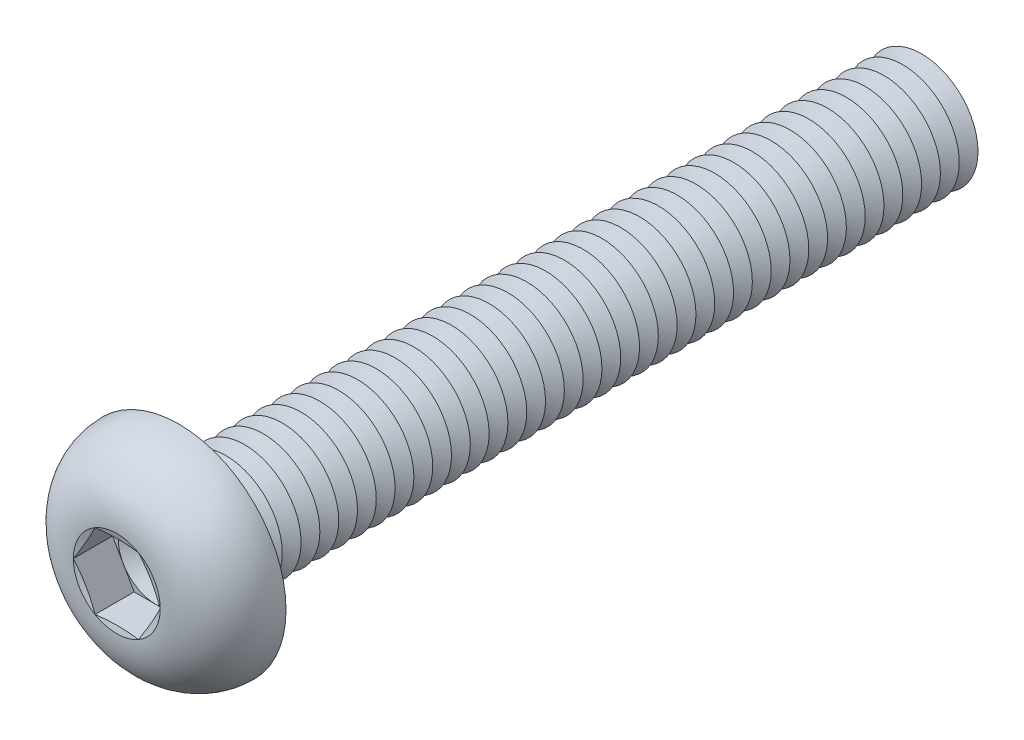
ISO-10303-21;
HEADER;
FILE_DESCRIPTION(('STEP AP214'),'2;1');
FILE_NAME('part.step','',(''),(''),'','','');
FILE_SCHEMA(('AUTOMOTIVE_DESIGN { 1 0 10303 214 1 1 1 1 }'));
ENDSEC;
DATA;
#1=APPLICATION_CONTEXT('core data for automotive mechanical design processes');
#2=APPLICATION_PROTOCOL_DEFINITION('international standard','automotive_design',2000,#1);
#3=PRODUCT_CONTEXT('',#1,'mechanical');
#4=PRODUCT('Part','Part','',(#3));
#5=PRODUCT_RELATED_PRODUCT_CATEGORY('part','',(#4));
#6=PRODUCT_DEFINITION_FORMATION('','',#4);
#7=PRODUCT_DEFINITION_CONTEXT('part definition',#1,'design');
#8=PRODUCT_DEFINITION('design','',#6,#7);
#9=PRODUCT_DEFINITION_SHAPE('','',#8);
#10=(LENGTH_UNIT() NAMED_UNIT(*) SI_UNIT(.MILLI.,.METRE.));
#11=(NAMED_UNIT(*) PLANE_ANGLE_UNIT() SI_UNIT($,.RADIAN.));
#12=(NAMED_UNIT(*) SI_UNIT($,.STERADIAN.) SOLID_ANGLE_UNIT());
#13=UNCERTAINTY_MEASURE_WITH_UNIT(LENGTH_MEASURE(1.E-05),#10,'distance_accuracy_value','');
#14=(GEOMETRIC_REPRESENTATION_CONTEXT(3) GLOBAL_UNCERTAINTY_ASSIGNED_CONTEXT((#13)) GLOBAL_UNIT_ASSIGNED_CONTEXT((#10,
#11,#12)) REPRESENTATION_CONTEXT('',''));
#15=CARTESIAN_POINT('',(0.,0.,0.));
#16=DIRECTION('',(0.,0.,1.));
#17=DIRECTION('',(1.,0.,0.));
#18=AXIS2_PLACEMENT_3D('',#15,#16,#17);
#19=CARTESIAN_POINT('',(0.,0.,0.609999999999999));
#20=DIRECTION('',(0.,0.,1.));
#21=DIRECTION('',(1.,0.,0.));
#22=AXIS2_PLACEMENT_3D('',#19,#20,#21);
#23=PLANE('',#22);
#24=CARTESIAN_POINT('',(0.,0.,0.609999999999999));
#25=DIRECTION('',(0.,0.,1.));
#26=DIRECTION('',(1.,0.,0.));
#27=AXIS2_PLACEMENT_3D('',#24,#25,#26);
#28=CIRCLE('',#27,0.999999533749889);
#29=CARTESIAN_POINT('',(0.866024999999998,0.499999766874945,0.609999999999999));
#30=VERTEX_POINT('',#29);
#31=CARTESIAN_POINT('',(0.,0.999999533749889,0.609999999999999));
#32=VERTEX_POINT('',#31);
#33=EDGE_CURVE('E118',#30,#32,#28,.T.);
#34=ORIENTED_EDGE('',*,*,#33,.F.);
#35=DIRECTION('',(-0.500000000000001,0.866025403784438,0.));
#36=VECTOR('',#35,1.);
#37=CARTESIAN_POINT('',(1.1547,0.,0.609999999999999));
#38=LINE('',#37,#36);
#39=CARTESIAN_POINT('',(0.577349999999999,0.999999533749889,0.609999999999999));
#40=VERTEX_POINT('',#39);
#41=EDGE_CURVE('E125',#30,#40,#38,.T.);
#42=ORIENTED_EDGE('',*,*,#41,.T.);
#43=DIRECTION('',(-1.,0.,0.));
#44=VECTOR('',#43,1.);
#45=CARTESIAN_POINT('',(0.577349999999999,0.999999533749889,0.609999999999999));
#46=LINE('',#45,#44);
#47=EDGE_CURVE('E136',#40,#32,#46,.T.);
#48=ORIENTED_EDGE('',*,*,#47,.T.);
#49=EDGE_LOOP('',(#34,#42,#48));
#50=FACE_BOUND('',#49,.T.);
#51=ADVANCED_FACE('F39',(#50),#23,.T.);
#52=CARTESIAN_POINT('',(0.,0.,0.609999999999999));
#53=DIRECTION('',(0.,0.,1.));
#54=DIRECTION('',(1.,0.,0.));
#55=AXIS2_PLACEMENT_3D('',#52,#53,#54);
#56=CIRCLE('',#55,0.999999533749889);
#57=CARTESIAN_POINT('',(-0.866024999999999,0.499999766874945,0.609999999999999));
#58=VERTEX_POINT('',#57);
#59=EDGE_CURVE('E11',#32,#58,#56,.T.);
#60=ORIENTED_EDGE('',*,*,#59,.F.);
#61=CARTESIAN_POINT('',(-0.577350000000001,0.999999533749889,0.609999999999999));
#62=VERTEX_POINT('',#61);
#63=EDGE_CURVE('E131',#32,#62,#46,.T.);
#64=ORIENTED_EDGE('',*,*,#63,.T.);
#65=DIRECTION('',(-0.5,-0.866025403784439,0.));
#66=VECTOR('',#65,1.);
#67=CARTESIAN_POINT('',(-0.577350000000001,0.999999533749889,0.609999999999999));
#68=LINE('',#67,#66);
#69=EDGE_CURVE('E134',#62,#58,#68,.T.);
#70=ORIENTED_EDGE('',*,*,#69,.T.);
#71=EDGE_LOOP('',(#60,#64,#70));
#72=FACE_BOUND('',#71,.T.);
#73=ADVANCED_FACE('F130',(#72),#23,.T.);
#74=CARTESIAN_POINT('',(-0.866024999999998,-0.499999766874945,0.609999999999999));
#75=VERTEX_POINT('',#74);
#76=EDGE_CURVE('E49',#58,#75,#56,.T.);
#77=ORIENTED_EDGE('',*,*,#76,.F.);
#78=CARTESIAN_POINT('',(-1.1547,0.,0.609999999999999));
#79=VERTEX_POINT('',#78);
#80=EDGE_CURVE('E143',#58,#79,#68,.T.);
#81=ORIENTED_EDGE('',*,*,#80,.T.);
#82=DIRECTION('',(0.5,-0.866025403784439,0.));
#83=VECTOR('',#82,1.);
#84=CARTESIAN_POINT('',(-1.1547,0.,0.609999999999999));
#85=LINE('',#84,#83);
#86=EDGE_CURVE('E151',#79,#75,#85,.T.);
#87=ORIENTED_EDGE('',*,*,#86,.T.);
#88=EDGE_LOOP('',(#77,#81,#87));
#89=FACE_BOUND('',#88,.T.);
#90=ADVANCED_FACE('F587',(#89),#23,.T.);
#91=CARTESIAN_POINT('',(0.,-0.999999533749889,0.609999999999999));
#92=VERTEX_POINT('',#91);
#93=EDGE_CURVE('E572',#75,#92,#56,.T.);
#94=ORIENTED_EDGE('',*,*,#93,.F.);
#95=CARTESIAN_POINT('',(-0.577349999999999,-0.99999953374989,0.609999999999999));
#96=VERTEX_POINT('',#95);
#97=EDGE_CURVE('E150',#75,#96,#85,.T.);
#98=ORIENTED_EDGE('',*,*,#97,.T.);
#99=DIRECTION('',(1.,0.,0.));
#100=VECTOR('',#99,1.);
#101=CARTESIAN_POINT('',(-0.577349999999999,-0.99999953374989,0.609999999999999));
#102=LINE('',#101,#100);
#103=EDGE_CURVE('E156',#96,#92,#102,.T.);
#104=ORIENTED_EDGE('',*,*,#103,.T.);
#105=EDGE_LOOP('',(#94,#98,#104));
#106=FACE_BOUND('',#105,.T.);
#107=ADVANCED_FACE('F581',(#106),#23,.T.);
#108=CARTESIAN_POINT('',(0.866024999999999,-0.499999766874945,0.609999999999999));
#109=VERTEX_POINT('',#108);
#110=EDGE_CURVE('E56',#92,#109,#56,.T.);
#111=ORIENTED_EDGE('',*,*,#110,.F.);
#112=CARTESIAN_POINT('',(0.577349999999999,-0.99999953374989,0.609999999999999));
#113=VERTEX_POINT('',#112);
#114=EDGE_CURVE('E155',#92,#113,#102,.T.);
#115=ORIENTED_EDGE('',*,*,#114,.T.);
#116=DIRECTION('',(0.5,0.866025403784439,0.));
#117=VECTOR('',#116,1.);
#118=CARTESIAN_POINT('',(0.577349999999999,-0.99999953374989,0.609999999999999));
#119=LINE('',#118,#117);
#120=EDGE_CURVE('E161',#113,#109,#119,.T.);
#121=ORIENTED_EDGE('',*,*,#120,.T.);
#122=EDGE_LOOP('',(#111,#115,#121));
#123=FACE_BOUND('',#122,.T.);
#124=ADVANCED_FACE('F649',(#123),#23,.T.);
#125=CARTESIAN_POINT('',(0.,0.,1.65));
#126=DIRECTION('',(0.,0.,1.));
#127=DIRECTION('',(1.,0.,0.));
#128=AXIS2_PLACEMENT_3D('',#125,#126,#127);
#129=CONICAL_SURFACE('',#128,1.1547,1.30899693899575);
#130=CARTESIAN_POINT('',(1.15481547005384,-0.000199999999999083,1.65003094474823));
#131=CARTESIAN_POINT('',(1.13083002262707,0.0413440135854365,1.64359970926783));
#132=CARTESIAN_POINT('',(1.10680107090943,0.0829633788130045,1.63776108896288));
#133=CARTESIAN_POINT('',(1.05865826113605,0.166349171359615,1.62750303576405));
#134=CARTESIAN_POINT('',(1.03454437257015,0.208115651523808,1.62308418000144));
#135=CARTESIAN_POINT('',(0.986377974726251,0.291542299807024,1.61592375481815));
#136=CARTESIAN_POINT('',(0.962325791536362,0.333201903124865,1.61317364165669));
#137=CARTESIAN_POINT('',(0.914190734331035,0.416574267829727,1.60948600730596));
#138=CARTESIAN_POINT('',(0.890107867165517,0.458287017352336,1.60854813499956));
#139=CARTESIAN_POINT('',(0.841942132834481,0.541712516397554,1.60854813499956));
#140=CARTESIAN_POINT('',(0.817859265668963,0.583425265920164,1.60948600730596));
#141=CARTESIAN_POINT('',(0.769724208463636,0.666797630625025,1.61317364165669));
#142=CARTESIAN_POINT('',(0.745672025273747,0.708457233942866,1.61592375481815));
#143=CARTESIAN_POINT('',(0.697505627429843,0.791883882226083,1.62308418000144));
#144=CARTESIAN_POINT('',(0.673391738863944,0.833650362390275,1.62750303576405));
#145=CARTESIAN_POINT('',(0.625248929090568,0.917036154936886,1.63776108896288));
#146=CARTESIAN_POINT('',(0.60121997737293,0.958655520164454,1.64359970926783));
#147=CARTESIAN_POINT('',(0.577234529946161,1.00019953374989,1.65003094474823));
#148=B_SPLINE_CURVE_WITH_KNOTS('',3,(#130,#131,#132,#133,#134,#135,#136,#137,#138,#139,#140,
#141,#142,#143,#144,#145,#146,#147),.UNSPECIFIED.,.F.,.F.,(4,2,2,2,2,2,2,2,4),(0.,
0.145207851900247,0.290474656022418,0.434991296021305,0.579479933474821,0.723968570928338,
0.868485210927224,1.0137520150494,1.15895986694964),.UNSPECIFIED.);
#149=CARTESIAN_POINT('',(1.1547,0.,1.65));
#150=VERTEX_POINT('',#149);
#151=CARTESIAN_POINT('',(0.57735,0.99999953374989,1.65));
#152=VERTEX_POINT('',#151);
#153=EDGE_CURVE('E220',#150,#152,#148,.T.);
#154=ORIENTED_EDGE('',*,*,#153,.F.);
#155=CARTESIAN_POINT('',(0.,0.,1.65));
#156=DIRECTION('',(0.,0.,-1.));
#157=DIRECTION('',(-1.,0.,0.));
#158=AXIS2_PLACEMENT_3D('',#155,#156,#157);
#159=CIRCLE('',#158,1.1547);
#160=EDGE_CURVE('E616',#152,#150,#159,.T.);
#161=ORIENTED_EDGE('',*,*,#160,.F.);
#162=EDGE_LOOP('',(#154,#161));
#163=FACE_BOUND('',#162,.T.);
#164=ADVANCED_FACE('F637',(#163),#129,.F.);
#165=CARTESIAN_POINT('',(0.577234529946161,-1.00019953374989,1.65003094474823));
#166=CARTESIAN_POINT('',(0.60121997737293,-0.958655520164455,1.64359970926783));
#167=CARTESIAN_POINT('',(0.625248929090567,-0.917036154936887,1.63776108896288));
#168=CARTESIAN_POINT('',(0.673391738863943,-0.833650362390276,1.62750303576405));
#169=CARTESIAN_POINT('',(0.697505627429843,-0.791883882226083,1.62308418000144));
#170=CARTESIAN_POINT('',(0.745672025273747,-0.708457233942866,1.61592375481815));
#171=CARTESIAN_POINT('',(0.769724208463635,-0.666797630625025,1.61317364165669));
#172=CARTESIAN_POINT('',(0.817859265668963,-0.583425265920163,1.60948600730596));
#173=CARTESIAN_POINT('',(0.84194213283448,-0.541712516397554,1.60854813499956));
#174=CARTESIAN_POINT('',(0.890107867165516,-0.458287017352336,1.60854813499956));
#175=CARTESIAN_POINT('',(0.914190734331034,-0.416574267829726,1.60948600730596));
#176=CARTESIAN_POINT('',(0.962325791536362,-0.333201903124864,1.61317364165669));
#177=CARTESIAN_POINT('',(0.98637797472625,-0.291542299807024,1.61592375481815));
#178=CARTESIAN_POINT('',(1.03454437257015,-0.208115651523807,1.62308418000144));
#179=CARTESIAN_POINT('',(1.05865826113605,-0.166349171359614,1.62750303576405));
#180=CARTESIAN_POINT('',(1.10680107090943,-0.0829633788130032,1.63776108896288));
#181=CARTESIAN_POINT('',(1.13083002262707,-0.0413440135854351,1.64359970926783));
#182=CARTESIAN_POINT('',(1.15481547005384,0.000200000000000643,1.65003094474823));
#183=B_SPLINE_CURVE_WITH_KNOTS('',3,(#165,#166,#167,#168,#169,#170,#171,#172,#173,#174,#175,
#176,#177,#178,#179,#180,#181,#182),.UNSPECIFIED.,.F.,.F.,(4,2,2,2,2,2,2,2,4),(0.,
0.145207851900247,0.290474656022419,0.434991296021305,0.579479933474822,0.723968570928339,
0.868485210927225,1.0137520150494,1.15895986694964),.UNSPECIFIED.);
#184=CARTESIAN_POINT('',(0.577349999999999,-0.99999953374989,1.65));
#185=VERTEX_POINT('',#184);
#186=EDGE_CURVE('E229',#185,#150,#183,.T.);
#187=ORIENTED_EDGE('',*,*,#186,.F.);
#188=EDGE_CURVE('E618',#150,#185,#159,.T.);
#189=ORIENTED_EDGE('',*,*,#188,.F.);
#190=EDGE_LOOP('',(#187,#189));
#191=FACE_BOUND('',#190,.T.);
#192=ADVANCED_FACE('F639',(#191),#129,.F.);
#193=CARTESIAN_POINT('',(-1.7425668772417,-0.99999953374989,1.87893949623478));
#194=CARTESIAN_POINT('',(-1.65819693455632,-0.99999953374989,1.85935934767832));
#195=CARTESIAN_POINT('',(-1.57375647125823,-0.99999953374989,1.84006351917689));
#196=CARTESIAN_POINT('',(-1.40464514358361,-0.99999953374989,1.80242908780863));
#197=CARTESIAN_POINT('',(-1.31997423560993,-0.99999953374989,1.78409068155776));
#198=CARTESIAN_POINT('',(-1.14955192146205,-0.99999953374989,1.74860242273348));
#199=CARTESIAN_POINT('',(-1.06379782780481,-0.99999953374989,1.73146532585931));
#200=CARTESIAN_POINT('',(-0.891887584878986,-0.99999953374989,1.69925819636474));
#201=CARTESIAN_POINT('',(-0.805731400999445,-0.99999953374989,1.68418834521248));
#202=CARTESIAN_POINT('',(-0.635256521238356,-0.99999953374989,1.65751615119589));
#203=CARTESIAN_POINT('',(-0.550951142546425,-0.99999953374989,1.64583105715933));
#204=CARTESIAN_POINT('',(-0.381865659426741,-0.99999953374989,1.62668811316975));
#205=CARTESIAN_POINT('',(-0.297085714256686,-0.99999953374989,1.61922892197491));
#206=CARTESIAN_POINT('',(-0.127577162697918,-0.99999953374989,1.60981453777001));
#207=CARTESIAN_POINT('',(-0.0428499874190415,-0.99999953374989,1.60783514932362));
#208=CARTESIAN_POINT('',(0.126542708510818,-0.99999953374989,1.60973012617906));
#209=CARTESIAN_POINT('',(0.211208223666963,-0.99999953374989,1.61360496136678));
#210=CARTESIAN_POINT('',(0.356115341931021,-0.99999953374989,1.62460226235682));
#211=CARTESIAN_POINT('',(0.416458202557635,-0.99999953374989,1.63048841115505));
#212=CARTESIAN_POINT('',(0.536893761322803,-0.99999953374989,1.64437752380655));
#213=CARTESIAN_POINT('',(0.596986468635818,-0.99999953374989,1.65238040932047));
#214=CARTESIAN_POINT('',(0.777275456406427,-0.99999953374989,1.67888855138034));
#215=CARTESIAN_POINT('',(0.897104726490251,-0.99999953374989,1.69985858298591));
#216=CARTESIAN_POINT('',(1.07751611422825,-0.99999953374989,1.73433574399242));
#217=CARTESIAN_POINT('',(1.1383777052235,-0.99999953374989,1.74646914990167));
#218=CARTESIAN_POINT('',(1.25994955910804,-0.99999953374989,1.7714845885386));
#219=CARTESIAN_POINT('',(1.32065982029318,-0.99999953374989,1.7843666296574));
#220=CARTESIAN_POINT('',(1.44162663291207,-0.99999953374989,1.81062164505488));
#221=CARTESIAN_POINT('',(1.50188385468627,-0.99999953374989,1.82399156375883));
#222=CARTESIAN_POINT('',(1.62229550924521,-0.99999953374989,1.85116781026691));
#223=CARTESIAN_POINT('',(1.68244994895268,-0.99999953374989,1.86497410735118));
#224=CARTESIAN_POINT('',(1.7425668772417,-0.99999953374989,1.87893949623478));
#225=B_SPLINE_CURVE_WITH_KNOTS('',3,(#193,#194,#195,#196,#197,#198,#199,#200,#201,#202,#203,
#204,#205,#206,#207,#208,#209,#210,#211,#212,#213,#214,#215,#216,#217,#218,#219,#220,#221,#222,
#223,#224),.UNSPECIFIED.,.F.,.F.,(4,2,2,2,2,2,2,2,2,2,2,2,2,2,2,4),(0.,0.259842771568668,
0.519738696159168,0.782071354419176,1.04442702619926,1.29968778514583,1.55486748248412,
1.80891865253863,2.06299021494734,2.24483732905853,2.42667771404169,2.79149503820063,
2.97767344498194,3.16385393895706,3.34902052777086,3.53417411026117),.UNSPECIFIED.);
#226=CARTESIAN_POINT('',(-0.577349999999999,-0.99999953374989,1.65));
#227=VERTEX_POINT('',#226);
#228=EDGE_CURVE('E598',#227,#185,#225,.T.);
#229=ORIENTED_EDGE('',*,*,#228,.F.);
#230=EDGE_CURVE('E606',#185,#227,#159,.T.);
#231=ORIENTED_EDGE('',*,*,#230,.F.);
#232=EDGE_LOOP('',(#229,#231));
#233=FACE_BOUND('',#232,.T.);
#234=ADVANCED_FACE('F643',(#233),#129,.F.);
#235=CARTESIAN_POINT('',(-1.15481547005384,0.000200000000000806,1.65003094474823));
#236=CARTESIAN_POINT('',(-1.13083002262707,-0.041344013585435,1.64359970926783));
#237=CARTESIAN_POINT('',(-1.10680107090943,-0.0829633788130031,1.63776108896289));
#238=CARTESIAN_POINT('',(-1.05865826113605,-0.166349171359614,1.62750303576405));
#239=CARTESIAN_POINT('',(-1.03454437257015,-0.208115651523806,1.62308418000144));
#240=CARTESIAN_POINT('',(-0.986377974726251,-0.291542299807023,1.61592375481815));
#241=CARTESIAN_POINT('',(-0.962325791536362,-0.333201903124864,1.61317364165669));
#242=CARTESIAN_POINT('',(-0.914190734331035,-0.416574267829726,1.60948600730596));
#243=CARTESIAN_POINT('',(-0.890107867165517,-0.458287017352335,1.60854813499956));
#244=CARTESIAN_POINT('',(-0.841942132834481,-0.541712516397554,1.60854813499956));
#245=CARTESIAN_POINT('',(-0.817859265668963,-0.583425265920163,1.60948600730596));
#246=CARTESIAN_POINT('',(-0.769724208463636,-0.666797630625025,1.61317364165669));
#247=CARTESIAN_POINT('',(-0.745672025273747,-0.708457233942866,1.61592375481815));
#248=CARTESIAN_POINT('',(-0.697505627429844,-0.791883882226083,1.62308418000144));
#249=CARTESIAN_POINT('',(-0.673391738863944,-0.833650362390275,1.62750303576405));
#250=CARTESIAN_POINT('',(-0.625248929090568,-0.917036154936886,1.63776108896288));
#251=CARTESIAN_POINT('',(-0.60121997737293,-0.958655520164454,1.64359970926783));
#252=CARTESIAN_POINT('',(-0.577234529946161,-1.00019953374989,1.65003094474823));
#253=B_SPLINE_CURVE_WITH_KNOTS('',3,(#235,#236,#237,#238,#239,#240,#241,#242,#243,#244,#245,
#246,#247,#248,#249,#250,#251,#252),.UNSPECIFIED.,.F.,.F.,(4,2,2,2,2,2,2,2,4),(0.,
0.145207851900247,0.290474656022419,0.434991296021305,0.579479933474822,0.723968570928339,
0.868485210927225,1.0137520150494,1.15895986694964),.UNSPECIFIED.);
#254=CARTESIAN_POINT('',(-1.1547,0.,1.65));
#255=VERTEX_POINT('',#254);
#256=EDGE_CURVE('E592',#255,#227,#253,.T.);
#257=ORIENTED_EDGE('',*,*,#256,.F.);
#258=EDGE_CURVE('E554',#227,#255,#159,.T.);
#259=ORIENTED_EDGE('',*,*,#258,.F.);
#260=EDGE_LOOP('',(#257,#259));
#261=FACE_BOUND('',#260,.T.);
#262=ADVANCED_FACE('F596',(#261),#129,.F.);
#263=CARTESIAN_POINT('',(-0.577234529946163,1.00019953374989,1.65003094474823));
#264=CARTESIAN_POINT('',(-0.601219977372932,0.958655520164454,1.64359970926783));
#265=CARTESIAN_POINT('',(-0.625248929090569,0.917036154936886,1.63776108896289));
#266=CARTESIAN_POINT('',(-0.673391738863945,0.833650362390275,1.62750303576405));
#267=CARTESIAN_POINT('',(-0.697505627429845,0.791883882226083,1.62308418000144));
#268=CARTESIAN_POINT('',(-0.745672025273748,0.708457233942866,1.61592375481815));
#269=CARTESIAN_POINT('',(-0.769724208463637,0.666797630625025,1.61317364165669));
#270=CARTESIAN_POINT('',(-0.817859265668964,0.583425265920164,1.60948600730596));
#271=CARTESIAN_POINT('',(-0.841942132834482,0.541712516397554,1.60854813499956));
#272=CARTESIAN_POINT('',(-0.890107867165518,0.458287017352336,1.60854813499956));
#273=CARTESIAN_POINT('',(-0.914190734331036,0.416574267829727,1.60948600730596));
#274=CARTESIAN_POINT('',(-0.962325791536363,0.333201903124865,1.61317364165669));
#275=CARTESIAN_POINT('',(-0.986377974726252,0.291542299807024,1.61592375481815));
#276=CARTESIAN_POINT('',(-1.03454437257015,0.208115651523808,1.62308418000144));
#277=CARTESIAN_POINT('',(-1.05865826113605,0.166349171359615,1.62750303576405));
#278=CARTESIAN_POINT('',(-1.10680107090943,0.0829633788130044,1.63776108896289));
#279=CARTESIAN_POINT('',(-1.13083002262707,0.0413440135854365,1.64359970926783));
#280=CARTESIAN_POINT('',(-1.15481547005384,-0.000199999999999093,1.65003094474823));
#281=B_SPLINE_CURVE_WITH_KNOTS('',3,(#263,#264,#265,#266,#267,#268,#269,#270,#271,#272,#273,
#274,#275,#276,#277,#278,#279,#280),.UNSPECIFIED.,.F.,.F.,(4,2,2,2,2,2,2,2,4),(0.,
0.145207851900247,0.290474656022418,0.434991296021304,0.579479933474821,0.723968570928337,
0.868485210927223,1.01375201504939,1.15895986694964),.UNSPECIFIED.);
#282=CARTESIAN_POINT('',(-0.577350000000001,0.999999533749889,1.65));
#283=VERTEX_POINT('',#282);
#284=EDGE_CURVE('E194',#283,#255,#281,.T.);
#285=ORIENTED_EDGE('',*,*,#284,.F.);
#286=EDGE_CURVE('E555',#255,#283,#159,.T.);
#287=ORIENTED_EDGE('',*,*,#286,.F.);
#288=EDGE_LOOP('',(#285,#287));
#289=FACE_BOUND('',#288,.T.);
#290=ADVANCED_FACE('F609',(#289),#129,.F.);
#291=CARTESIAN_POINT('',(0.,0.,-18.25));
#292=DIRECTION('',(0.,0.,1.));
#293=DIRECTION('',(1.,0.,0.));
#294=AXIS2_PLACEMENT_3D('',#291,#292,#293);
#295=CONICAL_SURFACE('',#294,1.50000000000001,1.0471975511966);
#296=CARTESIAN_POINT('',(0.,0.,-18.5));
#297=DIRECTION('',(0.,0.,1.));
#298=DIRECTION('',(1.,0.,0.));
#299=AXIS2_PLACEMENT_3D('',#296,#297,#298);
#300=CIRCLE('',#299,1.06698729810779);
#301=CARTESIAN_POINT('',(1.06698729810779,0.,-18.5));
#302=VERTEX_POINT('',#301);
#303=EDGE_CURVE('E526',#302,#302,#300,.T.);
#304=ORIENTED_EDGE('',*,*,#303,.T.);
#305=EDGE_LOOP('',(#304));
#306=FACE_BOUND('',#305,.T.);
#307=CARTESIAN_POINT('',(0.,0.,-18.25));
#308=DIRECTION('',(0.,0.,1.));
#309=DIRECTION('',(1.,0.,0.));
#310=AXIS2_PLACEMENT_3D('',#307,#308,#309);
#311=CIRCLE('',#310,1.50000000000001);
#312=CARTESIAN_POINT('',(1.50000000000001,0.,-18.25));
#313=VERTEX_POINT('',#312);
#314=EDGE_CURVE('E522',#313,#313,#311,.T.);
#315=ORIENTED_EDGE('',*,*,#314,.F.);
#316=EDGE_LOOP('',(#315));
#317=FACE_BOUND('',#316,.T.);
#318=ADVANCED_FACE('F704',(#306,#317),#295,.T.);
#319=CARTESIAN_POINT('',(0.,0.,-18.5));
#320=DIRECTION('',(0.,0.,-1.));
#321=DIRECTION('',(-1.,0.,0.));
#322=AXIS2_PLACEMENT_3D('',#319,#320,#321);
#323=CONICAL_SURFACE('',#322,1.06698729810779,1.0471975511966);
#324=CARTESIAN_POINT('',(0.,0.,-18.75));
#325=DIRECTION('',(0.,0.,1.));
#326=DIRECTION('',(1.,0.,0.));
#327=AXIS2_PLACEMENT_3D('',#324,#325,#326);
#328=CIRCLE('',#327,1.50000000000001);
#329=CARTESIAN_POINT('',(1.50000000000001,0.,-18.75));
#330=VERTEX_POINT('',#329);
#331=EDGE_CURVE('E530',#330,#330,#328,.T.);
#332=ORIENTED_EDGE('',*,*,#331,.T.);
#333=EDGE_LOOP('',(#332));
#334=FACE_BOUND('',#333,.T.);
#335=ORIENTED_EDGE('',*,*,#303,.F.);
#336=EDGE_LOOP('',(#335));
#337=FACE_BOUND('',#336,.T.);
#338=ADVANCED_FACE('F712',(#334,#337),#323,.T.);
#339=CARTESIAN_POINT('',(0.,1.50000000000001,-20.));
#340=DIRECTION('',(0.,0.,-1.));
#341=DIRECTION('',(-1.,0.,0.));
#342=AXIS2_PLACEMENT_3D('',#339,#340,#341);
#343=PLANE('',#342);
#344=CARTESIAN_POINT('',(0.,0.,-20.));
#345=DIRECTION('',(0.,0.,1.));
#346=DIRECTION('',(1.,0.,0.));
#347=AXIS2_PLACEMENT_3D('',#344,#345,#346);
#348=CIRCLE('',#347,1.06698729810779);
#349=CARTESIAN_POINT('',(1.06698729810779,0.,-20.));
#350=VERTEX_POINT('',#349);
#351=EDGE_CURVE('E550',#350,#350,#348,.T.);
#352=ORIENTED_EDGE('',*,*,#351,.F.);
#353=EDGE_LOOP('',(#352));
#354=FACE_BOUND('',#353,.T.);
#355=ADVANCED_FACE('F722',(#354),#343,.T.);
#356=CARTESIAN_POINT('',(0.,0.,-19.75));
#357=DIRECTION('',(0.,0.,1.));
#358=DIRECTION('',(1.,0.,0.));
#359=AXIS2_PLACEMENT_3D('',#356,#357,#358);
#360=CONICAL_SURFACE('',#359,1.50000000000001,1.0471975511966);
#361=ORIENTED_EDGE('',*,*,#351,.T.);
#362=EDGE_LOOP('',(#361));
#363=FACE_BOUND('',#362,.T.);
#364=CARTESIAN_POINT('',(0.,0.,-19.75));
#365=DIRECTION('',(0.,0.,1.));
#366=DIRECTION('',(1.,0.,0.));
#367=AXIS2_PLACEMENT_3D('',#364,#365,#366);
#368=CIRCLE('',#367,1.50000000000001);
#369=CARTESIAN_POINT('',(1.50000000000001,0.,-19.75));
#370=VERTEX_POINT('',#369);
#371=EDGE_CURVE('E546',#370,#370,#368,.T.);
#372=ORIENTED_EDGE('',*,*,#371,.F.);
#373=EDGE_LOOP('',(#372));
#374=FACE_BOUND('',#373,.T.);
#375=ADVANCED_FACE('F731',(#363,#374),#360,.T.);
#376=CARTESIAN_POINT('',(0.,0.,-19.5));
#377=DIRECTION('',(0.,0.,-1.));
#378=DIRECTION('',(-1.,0.,0.));
#379=AXIS2_PLACEMENT_3D('',#376,#377,#378);
#380=CONICAL_SURFACE('',#379,1.06698729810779,1.0471975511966);
#381=ORIENTED_EDGE('',*,*,#371,.T.);
#382=EDGE_LOOP('',(#381));
#383=FACE_BOUND('',#382,.T.);
#384=CARTESIAN_POINT('',(0.,0.,-19.5));
#385=DIRECTION('',(0.,0.,1.));
#386=DIRECTION('',(1.,0.,0.));
#387=AXIS2_PLACEMENT_3D('',#384,#385,#386);
#388=CIRCLE('',#387,1.06698729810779);
#389=CARTESIAN_POINT('',(1.06698729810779,0.,-19.5));
#390=VERTEX_POINT('',#389);
#391=EDGE_CURVE('E542',#390,#390,#388,.T.);
#392=ORIENTED_EDGE('',*,*,#391,.F.);
#393=EDGE_LOOP('',(#392));
#394=FACE_BOUND('',#393,.T.);
#395=ADVANCED_FACE('F739',(#383,#394),#380,.T.);
#396=CARTESIAN_POINT('',(0.,0.,-19.25));
#397=DIRECTION('',(0.,0.,1.));
#398=DIRECTION('',(1.,0.,0.));
#399=AXIS2_PLACEMENT_3D('',#396,#397,#398);
#400=CONICAL_SURFACE('',#399,1.50000000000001,1.0471975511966);
#401=ORIENTED_EDGE('',*,*,#391,.T.);
#402=EDGE_LOOP('',(#401));
#403=FACE_BOUND('',#402,.T.);
#404=CARTESIAN_POINT('',(0.,0.,-19.25));
#405=DIRECTION('',(0.,0.,1.));
#406=DIRECTION('',(1.,0.,0.));
#407=AXIS2_PLACEMENT_3D('',#404,#405,#406);
#408=CIRCLE('',#407,1.50000000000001);
#409=CARTESIAN_POINT('',(1.50000000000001,0.,-19.25));
#410=VERTEX_POINT('',#409);
#411=EDGE_CURVE('E538',#410,#410,#408,.T.);
#412=ORIENTED_EDGE('',*,*,#411,.F.);
#413=EDGE_LOOP('',(#412));
#414=FACE_BOUND('',#413,.T.);
#415=ADVANCED_FACE('F748',(#403,#414),#400,.T.);
#416=CARTESIAN_POINT('',(0.,0.,-19.));
#417=DIRECTION('',(0.,0.,-1.));
#418=DIRECTION('',(-1.,0.,0.));
#419=AXIS2_PLACEMENT_3D('',#416,#417,#418);
#420=CONICAL_SURFACE('',#419,1.06698729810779,1.0471975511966);
#421=ORIENTED_EDGE('',*,*,#411,.T.);
#422=EDGE_LOOP('',(#421));
#423=FACE_BOUND('',#422,.T.);
#424=CARTESIAN_POINT('',(0.,0.,-19.));
#425=DIRECTION('',(0.,0.,1.));
#426=DIRECTION('',(1.,0.,0.));
#427=AXIS2_PLACEMENT_3D('',#424,#425,#426);
#428=CIRCLE('',#427,1.06698729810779);
#429=CARTESIAN_POINT('',(1.06698729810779,0.,-19.));
#430=VERTEX_POINT('',#429);
#431=EDGE_CURVE('E534',#430,#430,#428,.T.);
#432=ORIENTED_EDGE('',*,*,#431,.F.);
#433=EDGE_LOOP('',(#432));
#434=FACE_BOUND('',#433,.T.);
#435=ADVANCED_FACE('F757',(#423,#434),#420,.T.);
#436=CARTESIAN_POINT('',(0.,0.,-18.75));
#437=DIRECTION('',(0.,0.,1.));
#438=DIRECTION('',(1.,0.,0.));
#439=AXIS2_PLACEMENT_3D('',#436,#437,#438);
#440=CONICAL_SURFACE('',#439,1.50000000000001,1.0471975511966);
#441=ORIENTED_EDGE('',*,*,#431,.T.);
#442=EDGE_LOOP('',(#441));
#443=FACE_BOUND('',#442,.T.);
#444=ORIENTED_EDGE('',*,*,#331,.F.);
#445=EDGE_LOOP('',(#444));
#446=FACE_BOUND('',#445,.T.);
#447=ADVANCED_FACE('F766',(#443,#446),#440,.T.);
#448=CARTESIAN_POINT('',(0.,0.,-17.75));
#449=DIRECTION('',(0.,0.,1.));
#450=DIRECTION('',(1.,0.,0.));
#451=AXIS2_PLACEMENT_3D('',#448,#449,#450);
#452=CONICAL_SURFACE('',#451,1.50000000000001,1.0471975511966);
#453=CARTESIAN_POINT('',(0.,0.,-18.));
#454=DIRECTION('',(0.,0.,1.));
#455=DIRECTION('',(1.,0.,0.));
#456=AXIS2_PLACEMENT_3D('',#453,#454,#455);
#457=CIRCLE('',#456,1.06698729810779);
#458=CARTESIAN_POINT('',(1.06698729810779,0.,-18.));
#459=VERTEX_POINT('',#458);
#460=EDGE_CURVE('E518',#459,#459,#457,.T.);
#461=ORIENTED_EDGE('',*,*,#460,.T.);
#462=EDGE_LOOP('',(#461));
#463=FACE_BOUND('',#462,.T.);
#464=CARTESIAN_POINT('',(0.,0.,-17.75));
#465=DIRECTION('',(0.,0.,1.));
#466=DIRECTION('',(1.,0.,0.));
#467=AXIS2_PLACEMENT_3D('',#464,#465,#466);
#468=CIRCLE('',#467,1.50000000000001);
#469=CARTESIAN_POINT('',(1.50000000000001,0.,-17.75));
#470=VERTEX_POINT('',#469);
#471=EDGE_CURVE('E514',#470,#470,#468,.T.);
#472=ORIENTED_EDGE('',*,*,#471,.F.);
#473=EDGE_LOOP('',(#472));
#474=FACE_BOUND('',#473,.T.);
#475=ADVANCED_FACE('F775',(#463,#474),#452,.T.);
#476=CARTESIAN_POINT('',(0.,0.,-18.));
#477=DIRECTION('',(0.,0.,-1.));
#478=DIRECTION('',(-1.,0.,0.));
#479=AXIS2_PLACEMENT_3D('',#476,#477,#478);
#480=CONICAL_SURFACE('',#479,1.06698729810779,1.0471975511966);
#481=ORIENTED_EDGE('',*,*,#314,.T.);
#482=EDGE_LOOP('',(#481));
#483=FACE_BOUND('',#482,.T.);
#484=ORIENTED_EDGE('',*,*,#460,.F.);
#485=EDGE_LOOP('',(#484));
#486=FACE_BOUND('',#485,.T.);
#487=ADVANCED_FACE('F784',(#483,#486),#480,.T.);
#488=CARTESIAN_POINT('',(0.,0.,-17.25));
#489=DIRECTION('',(0.,0.,1.));
#490=DIRECTION('',(1.,0.,0.));
#491=AXIS2_PLACEMENT_3D('',#488,#489,#490);
#492=CONICAL_SURFACE('',#491,1.50000000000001,1.0471975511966);
#493=CARTESIAN_POINT('',(0.,0.,-17.5));
#494=DIRECTION('',(0.,0.,1.));
#495=DIRECTION('',(1.,0.,0.));
#496=AXIS2_PLACEMENT_3D('',#493,#494,#495);
#497=CIRCLE('',#496,1.06698729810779);
#498=CARTESIAN_POINT('',(1.06698729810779,0.,-17.5));
#499=VERTEX_POINT('',#498);
#500=EDGE_CURVE('E510',#499,#499,#497,.T.);
#501=ORIENTED_EDGE('',*,*,#500,.T.);
#502=EDGE_LOOP('',(#501));
#503=FACE_BOUND('',#502,.T.);
#504=CARTESIAN_POINT('',(0.,0.,-17.25));
#505=DIRECTION('',(0.,0.,1.));
#506=DIRECTION('',(1.,0.,0.));
#507=AXIS2_PLACEMENT_3D('',#504,#505,#506);
#508=CIRCLE('',#507,1.50000000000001);
#509=CARTESIAN_POINT('',(1.50000000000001,0.,-17.25));
#510=VERTEX_POINT('',#509);
#511=EDGE_CURVE('E506',#510,#510,#508,.T.);
#512=ORIENTED_EDGE('',*,*,#511,.F.);
#513=EDGE_LOOP('',(#512));
#514=FACE_BOUND('',#513,.T.);
#515=ADVANCED_FACE('F793',(#503,#514),#492,.T.);
#516=CARTESIAN_POINT('',(0.,0.,-17.5));
#517=DIRECTION('',(0.,0.,-1.));
#518=DIRECTION('',(-1.,0.,0.));
#519=AXIS2_PLACEMENT_3D('',#516,#517,#518);
#520=CONICAL_SURFACE('',#519,1.06698729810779,1.0471975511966);
#521=ORIENTED_EDGE('',*,*,#471,.T.);
#522=EDGE_LOOP('',(#521));
#523=FACE_BOUND('',#522,.T.);
#524=ORIENTED_EDGE('',*,*,#500,.F.);
#525=EDGE_LOOP('',(#524));
#526=FACE_BOUND('',#525,.T.);
#527=ADVANCED_FACE('F802',(#523,#526),#520,.T.);
#528=CARTESIAN_POINT('',(0.,0.,-16.75));
#529=DIRECTION('',(0.,0.,1.));
#530=DIRECTION('',(1.,0.,0.));
#531=AXIS2_PLACEMENT_3D('',#528,#529,#530);
#532=CONICAL_SURFACE('',#531,1.50000000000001,1.0471975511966);
#533=CARTESIAN_POINT('',(0.,0.,-17.));
#534=DIRECTION('',(0.,0.,1.));
#535=DIRECTION('',(1.,0.,0.));
#536=AXIS2_PLACEMENT_3D('',#533,#534,#535);
#537=CIRCLE('',#536,1.06698729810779);
#538=CARTESIAN_POINT('',(1.06698729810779,0.,-17.));
#539=VERTEX_POINT('',#538);
#540=EDGE_CURVE('E502',#539,#539,#537,.T.);
#541=ORIENTED_EDGE('',*,*,#540,.T.);
#542=EDGE_LOOP('',(#541));
#543=FACE_BOUND('',#542,.T.);
#544=CARTESIAN_POINT('',(0.,0.,-16.75));
#545=DIRECTION('',(0.,0.,1.));
#546=DIRECTION('',(1.,0.,0.));
#547=AXIS2_PLACEMENT_3D('',#544,#545,#546);
#548=CIRCLE('',#547,1.50000000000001);
#549=CARTESIAN_POINT('',(1.50000000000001,0.,-16.75));
#550=VERTEX_POINT('',#549);
#551=EDGE_CURVE('E498',#550,#550,#548,.T.);
#552=ORIENTED_EDGE('',*,*,#551,.F.);
#553=EDGE_LOOP('',(#552));
#554=FACE_BOUND('',#553,.T.);
#555=ADVANCED_FACE('F811',(#543,#554),#532,.T.);
#556=CARTESIAN_POINT('',(0.,0.,-17.));
#557=DIRECTION('',(0.,0.,-1.));
#558=DIRECTION('',(-1.,0.,0.));
#559=AXIS2_PLACEMENT_3D('',#556,#557,#558);
#560=CONICAL_SURFACE('',#559,1.06698729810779,1.0471975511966);
#561=ORIENTED_EDGE('',*,*,#511,.T.);
#562=EDGE_LOOP('',(#561));
#563=FACE_BOUND('',#562,.T.);
#564=ORIENTED_EDGE('',*,*,#540,.F.);
#565=EDGE_LOOP('',(#564));
#566=FACE_BOUND('',#565,.T.);
#567=ADVANCED_FACE('F820',(#563,#566),#560,.T.);
#568=CARTESIAN_POINT('',(0.,0.,-16.25));
#569=DIRECTION('',(0.,0.,1.));
#570=DIRECTION('',(1.,0.,0.));
#571=AXIS2_PLACEMENT_3D('',#568,#569,#570);
#572=CONICAL_SURFACE('',#571,1.50000000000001,1.0471975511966);
#573=CARTESIAN_POINT('',(0.,0.,-16.5));
#574=DIRECTION('',(0.,0.,1.));
#575=DIRECTION('',(1.,0.,0.));
#576=AXIS2_PLACEMENT_3D('',#573,#574,#575);
#577=CIRCLE('',#576,1.06698729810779);
#578=CARTESIAN_POINT('',(1.06698729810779,0.,-16.5));
#579=VERTEX_POINT('',#578);
#580=EDGE_CURVE('E494',#579,#579,#577,.T.);
#581=ORIENTED_EDGE('',*,*,#580,.T.);
#582=EDGE_LOOP('',(#581));
#583=FACE_BOUND('',#582,.T.);
#584=CARTESIAN_POINT('',(0.,0.,-16.25));
#585=DIRECTION('',(0.,0.,1.));
#586=DIRECTION('',(1.,0.,0.));
#587=AXIS2_PLACEMENT_3D('',#584,#585,#586);
#588=CIRCLE('',#587,1.50000000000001);
#589=CARTESIAN_POINT('',(1.50000000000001,0.,-16.25));
#590=VERTEX_POINT('',#589);
#591=EDGE_CURVE('E490',#590,#590,#588,.T.);
#592=ORIENTED_EDGE('',*,*,#591,.F.);
#593=EDGE_LOOP('',(#592));
#594=FACE_BOUND('',#593,.T.);
#595=ADVANCED_FACE('F829',(#583,#594),#572,.T.);
#596=CARTESIAN_POINT('',(0.,0.,-16.5));
#597=DIRECTION('',(0.,0.,-1.));
#598=DIRECTION('',(-1.,0.,0.));
#599=AXIS2_PLACEMENT_3D('',#596,#597,#598);
#600=CONICAL_SURFACE('',#599,1.06698729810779,1.0471975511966);
#601=ORIENTED_EDGE('',*,*,#551,.T.);
#602=EDGE_LOOP('',(#601));
#603=FACE_BOUND('',#602,.T.);
#604=ORIENTED_EDGE('',*,*,#580,.F.);
#605=EDGE_LOOP('',(#604));
#606=FACE_BOUND('',#605,.T.);
#607=ADVANCED_FACE('F838',(#603,#606),#600,.T.);
#608=CARTESIAN_POINT('',(0.,0.,-15.75));
#609=DIRECTION('',(0.,0.,1.));
#610=DIRECTION('',(1.,0.,0.));
#611=AXIS2_PLACEMENT_3D('',#608,#609,#610);
#612=CONICAL_SURFACE('',#611,1.50000000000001,1.0471975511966);
#613=CARTESIAN_POINT('',(0.,0.,-16.));
#614=DIRECTION('',(0.,0.,1.));
#615=DIRECTION('',(1.,0.,0.));
#616=AXIS2_PLACEMENT_3D('',#613,#614,#615);
#617=CIRCLE('',#616,1.06698729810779);
#618=CARTESIAN_POINT('',(1.06698729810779,0.,-16.));
#619=VERTEX_POINT('',#618);
#620=EDGE_CURVE('E486',#619,#619,#617,.T.);
#621=ORIENTED_EDGE('',*,*,#620,.T.);
#622=EDGE_LOOP('',(#621));
#623=FACE_BOUND('',#622,.T.);
#624=CARTESIAN_POINT('',(0.,0.,-15.75));
#625=DIRECTION('',(0.,0.,1.));
#626=DIRECTION('',(1.,0.,0.));
#627=AXIS2_PLACEMENT_3D('',#624,#625,#626);
#628=CIRCLE('',#627,1.50000000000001);
#629=CARTESIAN_POINT('',(1.50000000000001,0.,-15.75));
#630=VERTEX_POINT('',#629);
#631=EDGE_CURVE('E482',#630,#630,#628,.T.);
#632=ORIENTED_EDGE('',*,*,#631,.F.);
#633=EDGE_LOOP('',(#632));
#634=FACE_BOUND('',#633,.T.);
#635=ADVANCED_FACE('F847',(#623,#634),#612,.T.);
#636=CARTESIAN_POINT('',(0.,0.,-16.));
#637=DIRECTION('',(0.,0.,-1.));
#638=DIRECTION('',(-1.,0.,0.));
#639=AXIS2_PLACEMENT_3D('',#636,#637,#638);
#640=CONICAL_SURFACE('',#639,1.06698729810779,1.0471975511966);
#641=ORIENTED_EDGE('',*,*,#591,.T.);
#642=EDGE_LOOP('',(#641));
#643=FACE_BOUND('',#642,.T.);
#644=ORIENTED_EDGE('',*,*,#620,.F.);
#645=EDGE_LOOP('',(#644));
#646=FACE_BOUND('',#645,.T.);
#647=ADVANCED_FACE('F856',(#643,#646),#640,.T.);
#648=CARTESIAN_POINT('',(0.,0.,-15.25));
#649=DIRECTION('',(0.,0.,1.));
#650=DIRECTION('',(1.,0.,0.));
#651=AXIS2_PLACEMENT_3D('',#648,#649,#650);
#652=CONICAL_SURFACE('',#651,1.50000000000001,1.0471975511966);
#653=CARTESIAN_POINT('',(0.,0.,-15.5));
#654=DIRECTION('',(0.,0.,1.));
#655=DIRECTION('',(1.,0.,0.));
#656=AXIS2_PLACEMENT_3D('',#653,#654,#655);
#657=CIRCLE('',#656,1.06698729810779);
#658=CARTESIAN_POINT('',(1.06698729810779,0.,-15.5));
#659=VERTEX_POINT('',#658);
#660=EDGE_CURVE('E478',#659,#659,#657,.T.);
#661=ORIENTED_EDGE('',*,*,#660,.T.);
#662=EDGE_LOOP('',(#661));
#663=FACE_BOUND('',#662,.T.);
#664=CARTESIAN_POINT('',(0.,0.,-15.25));
#665=DIRECTION('',(0.,0.,1.));
#666=DIRECTION('',(1.,0.,0.));
#667=AXIS2_PLACEMENT_3D('',#664,#665,#666);
#668=CIRCLE('',#667,1.50000000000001);
#669=CARTESIAN_POINT('',(1.50000000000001,0.,-15.25));
#670=VERTEX_POINT('',#669);
#671=EDGE_CURVE('E474',#670,#670,#668,.T.);
#672=ORIENTED_EDGE('',*,*,#671,.F.);
#673=EDGE_LOOP('',(#672));
#674=FACE_BOUND('',#673,.T.);
#675=ADVANCED_FACE('F865',(#663,#674),#652,.T.);
#676=CARTESIAN_POINT('',(0.,0.,-15.5));
#677=DIRECTION('',(0.,0.,-1.));
#678=DIRECTION('',(-1.,0.,0.));
#679=AXIS2_PLACEMENT_3D('',#676,#677,#678);
#680=CONICAL_SURFACE('',#679,1.06698729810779,1.0471975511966);
#681=ORIENTED_EDGE('',*,*,#631,.T.);
#682=EDGE_LOOP('',(#681));
#683=FACE_BOUND('',#682,.T.);
#684=ORIENTED_EDGE('',*,*,#660,.F.);
#685=EDGE_LOOP('',(#684));
#686=FACE_BOUND('',#685,.T.);
#687=ADVANCED_FACE('F874',(#683,#686),#680,.T.);
#688=CARTESIAN_POINT('',(0.,0.,-14.75));
#689=DIRECTION('',(0.,0.,1.));
#690=DIRECTION('',(1.,0.,0.));
#691=AXIS2_PLACEMENT_3D('',#688,#689,#690);
#692=CONICAL_SURFACE('',#691,1.50000000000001,1.0471975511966);
#693=CARTESIAN_POINT('',(0.,0.,-15.));
#694=DIRECTION('',(0.,0.,1.));
#695=DIRECTION('',(1.,0.,0.));
#696=AXIS2_PLACEMENT_3D('',#693,#694,#695);
#697=CIRCLE('',#696,1.06698729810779);
#698=CARTESIAN_POINT('',(1.06698729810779,0.,-15.));
#699=VERTEX_POINT('',#698);
#700=EDGE_CURVE('E470',#699,#699,#697,.T.);
#701=ORIENTED_EDGE('',*,*,#700,.T.);
#702=EDGE_LOOP('',(#701));
#703=FACE_BOUND('',#702,.T.);
#704=CARTESIAN_POINT('',(0.,0.,-14.75));
#705=DIRECTION('',(0.,0.,1.));
#706=DIRECTION('',(1.,0.,0.));
#707=AXIS2_PLACEMENT_3D('',#704,#705,#706);
#708=CIRCLE('',#707,1.50000000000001);
#709=CARTESIAN_POINT('',(1.50000000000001,0.,-14.75));
#710=VERTEX_POINT('',#709);
#711=EDGE_CURVE('E466',#710,#710,#708,.T.);
#712=ORIENTED_EDGE('',*,*,#711,.F.);
#713=EDGE_LOOP('',(#712));
#714=FACE_BOUND('',#713,.T.);
#715=ADVANCED_FACE('F883',(#703,#714),#692,.T.);
#716=CARTESIAN_POINT('',(0.,0.,-15.));
#717=DIRECTION('',(0.,0.,-1.));
#718=DIRECTION('',(-1.,0.,0.));
#719=AXIS2_PLACEMENT_3D('',#716,#717,#718);
#720=CONICAL_SURFACE('',#719,1.06698729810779,1.0471975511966);
#721=ORIENTED_EDGE('',*,*,#671,.T.);
#722=EDGE_LOOP('',(#721));
#723=FACE_BOUND('',#722,.T.);
#724=ORIENTED_EDGE('',*,*,#700,.F.);
#725=EDGE_LOOP('',(#724));
#726=FACE_BOUND('',#725,.T.);
#727=ADVANCED_FACE('F892',(#723,#726),#720,.T.);
#728=CARTESIAN_POINT('',(0.,0.,-14.25));
#729=DIRECTION('',(0.,0.,1.));
#730=DIRECTION('',(1.,0.,0.));
#731=AXIS2_PLACEMENT_3D('',#728,#729,#730);
#732=CONICAL_SURFACE('',#731,1.50000000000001,1.0471975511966);
#733=CARTESIAN_POINT('',(0.,0.,-14.5));
#734=DIRECTION('',(0.,0.,1.));
#735=DIRECTION('',(1.,0.,0.));
#736=AXIS2_PLACEMENT_3D('',#733,#734,#735);
#737=CIRCLE('',#736,1.06698729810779);
#738=CARTESIAN_POINT('',(1.06698729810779,0.,-14.5));
#739=VERTEX_POINT('',#738);
#740=EDGE_CURVE('E462',#739,#739,#737,.T.);
#741=ORIENTED_EDGE('',*,*,#740,.T.);
#742=EDGE_LOOP('',(#741));
#743=FACE_BOUND('',#742,.T.);
#744=CARTESIAN_POINT('',(0.,0.,-14.25));
#745=DIRECTION('',(0.,0.,1.));
#746=DIRECTION('',(1.,0.,0.));
#747=AXIS2_PLACEMENT_3D('',#744,#745,#746);
#748=CIRCLE('',#747,1.50000000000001);
#749=CARTESIAN_POINT('',(1.50000000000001,0.,-14.25));
#750=VERTEX_POINT('',#749);
#751=EDGE_CURVE('E458',#750,#750,#748,.T.);
#752=ORIENTED_EDGE('',*,*,#751,.F.);
#753=EDGE_LOOP('',(#752));
#754=FACE_BOUND('',#753,.T.);
#755=ADVANCED_FACE('F901',(#743,#754),#732,.T.);
#756=CARTESIAN_POINT('',(0.,0.,-14.5));
#757=DIRECTION('',(0.,0.,-1.));
#758=DIRECTION('',(-1.,0.,0.));
#759=AXIS2_PLACEMENT_3D('',#756,#757,#758);
#760=CONICAL_SURFACE('',#759,1.06698729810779,1.0471975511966);
#761=ORIENTED_EDGE('',*,*,#711,.T.);
#762=EDGE_LOOP('',(#761));
#763=FACE_BOUND('',#762,.T.);
#764=ORIENTED_EDGE('',*,*,#740,.F.);
#765=EDGE_LOOP('',(#764));
#766=FACE_BOUND('',#765,.T.);
#767=ADVANCED_FACE('F910',(#763,#766),#760,.T.);
#768=CARTESIAN_POINT('',(0.,0.,-13.75));
#769=DIRECTION('',(0.,0.,1.));
#770=DIRECTION('',(1.,0.,0.));
#771=AXIS2_PLACEMENT_3D('',#768,#769,#770);
#772=CONICAL_SURFACE('',#771,1.50000000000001,1.0471975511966);
#773=CARTESIAN_POINT('',(0.,0.,-14.));
#774=DIRECTION('',(0.,0.,1.));
#775=DIRECTION('',(1.,0.,0.));
#776=AXIS2_PLACEMENT_3D('',#773,#774,#775);
#777=CIRCLE('',#776,1.06698729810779);
#778=CARTESIAN_POINT('',(1.06698729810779,0.,-14.));
#779=VERTEX_POINT('',#778);
#780=EDGE_CURVE('E454',#779,#779,#777,.T.);
#781=ORIENTED_EDGE('',*,*,#780,.T.);
#782=EDGE_LOOP('',(#781));
#783=FACE_BOUND('',#782,.T.);
#784=CARTESIAN_POINT('',(0.,0.,-13.75));
#785=DIRECTION('',(0.,0.,1.));
#786=DIRECTION('',(1.,0.,0.));
#787=AXIS2_PLACEMENT_3D('',#784,#785,#786);
#788=CIRCLE('',#787,1.50000000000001);
#789=CARTESIAN_POINT('',(1.50000000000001,0.,-13.75));
#790=VERTEX_POINT('',#789);
#791=EDGE_CURVE('E450',#790,#790,#788,.T.);
#792=ORIENTED_EDGE('',*,*,#791,.F.);
#793=EDGE_LOOP('',(#792));
#794=FACE_BOUND('',#793,.T.);
#795=ADVANCED_FACE('F919',(#783,#794),#772,.T.);
#796=CARTESIAN_POINT('',(0.,0.,-14.));
#797=DIRECTION('',(0.,0.,-1.));
#798=DIRECTION('',(-1.,0.,0.));
#799=AXIS2_PLACEMENT_3D('',#796,#797,#798);
#800=CONICAL_SURFACE('',#799,1.06698729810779,1.0471975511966);
#801=ORIENTED_EDGE('',*,*,#751,.T.);
#802=EDGE_LOOP('',(#801));
#803=FACE_BOUND('',#802,.T.);
#804=ORIENTED_EDGE('',*,*,#780,.F.);
#805=EDGE_LOOP('',(#804));
#806=FACE_BOUND('',#805,.T.);
#807=ADVANCED_FACE('F928',(#803,#806),#800,.T.);
#808=CARTESIAN_POINT('',(0.,0.,-13.25));
#809=DIRECTION('',(0.,0.,1.));
#810=DIRECTION('',(1.,0.,0.));
#811=AXIS2_PLACEMENT_3D('',#808,#809,#810);
#812=CONICAL_SURFACE('',#811,1.50000000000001,1.0471975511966);
#813=CARTESIAN_POINT('',(0.,0.,-13.5));
#814=DIRECTION('',(0.,0.,1.));
#815=DIRECTION('',(1.,0.,0.));
#816=AXIS2_PLACEMENT_3D('',#813,#814,#815);
#817=CIRCLE('',#816,1.06698729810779);
#818=CARTESIAN_POINT('',(1.06698729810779,0.,-13.5));
#819=VERTEX_POINT('',#818);
#820=EDGE_CURVE('E446',#819,#819,#817,.T.);
#821=ORIENTED_EDGE('',*,*,#820,.T.);
#822=EDGE_LOOP('',(#821));
#823=FACE_BOUND('',#822,.T.);
#824=CARTESIAN_POINT('',(0.,0.,-13.25));
#825=DIRECTION('',(0.,0.,1.));
#826=DIRECTION('',(1.,0.,0.));
#827=AXIS2_PLACEMENT_3D('',#824,#825,#826);
#828=CIRCLE('',#827,1.50000000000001);
#829=CARTESIAN_POINT('',(1.50000000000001,0.,-13.25));
#830=VERTEX_POINT('',#829);
#831=EDGE_CURVE('E442',#830,#830,#828,.T.);
#832=ORIENTED_EDGE('',*,*,#831,.F.);
#833=EDGE_LOOP('',(#832));
#834=FACE_BOUND('',#833,.T.);
#835=ADVANCED_FACE('F937',(#823,#834),#812,.T.);
#836=CARTESIAN_POINT('',(0.,0.,-13.5));
#837=DIRECTION('',(0.,0.,-1.));
#838=DIRECTION('',(-1.,0.,0.));
#839=AXIS2_PLACEMENT_3D('',#836,#837,#838);
#840=CONICAL_SURFACE('',#839,1.06698729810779,1.0471975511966);
#841=ORIENTED_EDGE('',*,*,#791,.T.);
#842=EDGE_LOOP('',(#841));
#843=FACE_BOUND('',#842,.T.);
#844=ORIENTED_EDGE('',*,*,#820,.F.);
#845=EDGE_LOOP('',(#844));
#846=FACE_BOUND('',#845,.T.);
#847=ADVANCED_FACE('F946',(#843,#846),#840,.T.);
#848=CARTESIAN_POINT('',(0.,0.,-12.75));
#849=DIRECTION('',(0.,0.,1.));
#850=DIRECTION('',(1.,0.,0.));
#851=AXIS2_PLACEMENT_3D('',#848,#849,#850);
#852=CONICAL_SURFACE('',#851,1.50000000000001,1.0471975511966);
#853=CARTESIAN_POINT('',(0.,0.,-13.));
#854=DIRECTION('',(0.,0.,1.));
#855=DIRECTION('',(1.,0.,0.));
#856=AXIS2_PLACEMENT_3D('',#853,#854,#855);
#857=CIRCLE('',#856,1.06698729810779);
#858=CARTESIAN_POINT('',(1.06698729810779,0.,-13.));
#859=VERTEX_POINT('',#858);
#860=EDGE_CURVE('E438',#859,#859,#857,.T.);
#861=ORIENTED_EDGE('',*,*,#860,.T.);
#862=EDGE_LOOP('',(#861));
#863=FACE_BOUND('',#862,.T.);
#864=CARTESIAN_POINT('',(0.,0.,-12.75));
#865=DIRECTION('',(0.,0.,1.));
#866=DIRECTION('',(1.,0.,0.));
#867=AXIS2_PLACEMENT_3D('',#864,#865,#866);
#868=CIRCLE('',#867,1.50000000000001);
#869=CARTESIAN_POINT('',(1.50000000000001,0.,-12.75));
#870=VERTEX_POINT('',#869);
#871=EDGE_CURVE('E434',#870,#870,#868,.T.);
#872=ORIENTED_EDGE('',*,*,#871,.F.);
#873=EDGE_LOOP('',(#872));
#874=FACE_BOUND('',#873,.T.);
#875=ADVANCED_FACE('F955',(#863,#874),#852,.T.);
#876=CARTESIAN_POINT('',(0.,0.,-13.));
#877=DIRECTION('',(0.,0.,-1.));
#878=DIRECTION('',(-1.,0.,0.));
#879=AXIS2_PLACEMENT_3D('',#876,#877,#878);
#880=CONICAL_SURFACE('',#879,1.06698729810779,1.0471975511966);
#881=ORIENTED_EDGE('',*,*,#831,.T.);
#882=EDGE_LOOP('',(#881));
#883=FACE_BOUND('',#882,.T.);
#884=ORIENTED_EDGE('',*,*,#860,.F.);
#885=EDGE_LOOP('',(#884));
#886=FACE_BOUND('',#885,.T.);
#887=ADVANCED_FACE('F964',(#883,#886),#880,.T.);
#888=CARTESIAN_POINT('',(0.,0.,-12.25));
#889=DIRECTION('',(0.,0.,1.));
#890=DIRECTION('',(1.,0.,0.));
#891=AXIS2_PLACEMENT_3D('',#888,#889,#890);
#892=CONICAL_SURFACE('',#891,1.50000000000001,1.0471975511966);
#893=CARTESIAN_POINT('',(0.,0.,-12.5));
#894=DIRECTION('',(0.,0.,1.));
#895=DIRECTION('',(1.,0.,0.));
#896=AXIS2_PLACEMENT_3D('',#893,#894,#895);
#897=CIRCLE('',#896,1.06698729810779);
#898=CARTESIAN_POINT('',(1.06698729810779,0.,-12.5));
#899=VERTEX_POINT('',#898);
#900=EDGE_CURVE('E430',#899,#899,#897,.T.);
#901=ORIENTED_EDGE('',*,*,#900,.T.);
#902=EDGE_LOOP('',(#901));
#903=FACE_BOUND('',#902,.T.);
#904=CARTESIAN_POINT('',(0.,0.,-12.25));
#905=DIRECTION('',(0.,0.,1.));
#906=DIRECTION('',(1.,0.,0.));
#907=AXIS2_PLACEMENT_3D('',#904,#905,#906);
#908=CIRCLE('',#907,1.50000000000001);
#909=CARTESIAN_POINT('',(1.50000000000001,0.,-12.25));
#910=VERTEX_POINT('',#909);
#911=EDGE_CURVE('E426',#910,#910,#908,.T.);
#912=ORIENTED_EDGE('',*,*,#911,.F.);
#913=EDGE_LOOP('',(#912));
#914=FACE_BOUND('',#913,.T.);
#915=ADVANCED_FACE('F973',(#903,#914),#892,.T.);
#916=CARTESIAN_POINT('',(0.,0.,-12.5));
#917=DIRECTION('',(0.,0.,-1.));
#918=DIRECTION('',(-1.,0.,0.));
#919=AXIS2_PLACEMENT_3D('',#916,#917,#918);
#920=CONICAL_SURFACE('',#919,1.06698729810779,1.0471975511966);
#921=ORIENTED_EDGE('',*,*,#871,.T.);
#922=EDGE_LOOP('',(#921));
#923=FACE_BOUND('',#922,.T.);
#924=ORIENTED_EDGE('',*,*,#900,.F.);
#925=EDGE_LOOP('',(#924));
#926=FACE_BOUND('',#925,.T.);
#927=ADVANCED_FACE('F982',(#923,#926),#920,.T.);
#928=CARTESIAN_POINT('',(0.,0.,-11.75));
#929=DIRECTION('',(0.,0.,1.));
#930=DIRECTION('',(1.,0.,0.));
#931=AXIS2_PLACEMENT_3D('',#928,#929,#930);
#932=CONICAL_SURFACE('',#931,1.50000000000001,1.0471975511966);
#933=CARTESIAN_POINT('',(0.,0.,-12.));
#934=DIRECTION('',(0.,0.,1.));
#935=DIRECTION('',(1.,0.,0.));
#936=AXIS2_PLACEMENT_3D('',#933,#934,#935);
#937=CIRCLE('',#936,1.06698729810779);
#938=CARTESIAN_POINT('',(1.06698729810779,0.,-12.));
#939=VERTEX_POINT('',#938);
#940=EDGE_CURVE('E422',#939,#939,#937,.T.);
#941=ORIENTED_EDGE('',*,*,#940,.T.);
#942=EDGE_LOOP('',(#941));
#943=FACE_BOUND('',#942,.T.);
#944=CARTESIAN_POINT('',(0.,0.,-11.75));
#945=DIRECTION('',(0.,0.,1.));
#946=DIRECTION('',(1.,0.,0.));
#947=AXIS2_PLACEMENT_3D('',#944,#945,#946);
#948=CIRCLE('',#947,1.50000000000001);
#949=CARTESIAN_POINT('',(1.50000000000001,0.,-11.75));
#950=VERTEX_POINT('',#949);
#951=EDGE_CURVE('E418',#950,#950,#948,.T.);
#952=ORIENTED_EDGE('',*,*,#951,.F.);
#953=EDGE_LOOP('',(#952));
#954=FACE_BOUND('',#953,.T.);
#955=ADVANCED_FACE('F991',(#943,#954),#932,.T.);
#956=CARTESIAN_POINT('',(0.,0.,-12.));
#957=DIRECTION('',(0.,0.,-1.));
#958=DIRECTION('',(-1.,0.,0.));
#959=AXIS2_PLACEMENT_3D('',#956,#957,#958);
#960=CONICAL_SURFACE('',#959,1.06698729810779,1.0471975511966);
#961=ORIENTED_EDGE('',*,*,#911,.T.);
#962=EDGE_LOOP('',(#961));
#963=FACE_BOUND('',#962,.T.);
#964=ORIENTED_EDGE('',*,*,#940,.F.);
#965=EDGE_LOOP('',(#964));
#966=FACE_BOUND('',#965,.T.);
#967=ADVANCED_FACE('F1000',(#963,#966),#960,.T.);
#968=CARTESIAN_POINT('',(0.,0.,-11.25));
#969=DIRECTION('',(0.,0.,1.));
#970=DIRECTION('',(1.,0.,0.));
#971=AXIS2_PLACEMENT_3D('',#968,#969,#970);
#972=CONICAL_SURFACE('',#971,1.50000000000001,1.0471975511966);
#973=CARTESIAN_POINT('',(0.,0.,-11.5));
#974=DIRECTION('',(0.,0.,1.));
#975=DIRECTION('',(1.,0.,0.));
#976=AXIS2_PLACEMENT_3D('',#973,#974,#975);
#977=CIRCLE('',#976,1.06698729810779);
#978=CARTESIAN_POINT('',(1.06698729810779,0.,-11.5));
#979=VERTEX_POINT('',#978);
#980=EDGE_CURVE('E414',#979,#979,#977,.T.);
#981=ORIENTED_EDGE('',*,*,#980,.T.);
#982=EDGE_LOOP('',(#981));
#983=FACE_BOUND('',#982,.T.);
#984=CARTESIAN_POINT('',(0.,0.,-11.25));
#985=DIRECTION('',(0.,0.,1.));
#986=DIRECTION('',(1.,0.,0.));
#987=AXIS2_PLACEMENT_3D('',#984,#985,#986);
#988=CIRCLE('',#987,1.50000000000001);
#989=CARTESIAN_POINT('',(1.50000000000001,0.,-11.25));
#990=VERTEX_POINT('',#989);
#991=EDGE_CURVE('E410',#990,#990,#988,.T.);
#992=ORIENTED_EDGE('',*,*,#991,.F.);
#993=EDGE_LOOP('',(#992));
#994=FACE_BOUND('',#993,.T.);
#995=ADVANCED_FACE('F1009',(#983,#994),#972,.T.);
#996=CARTESIAN_POINT('',(0.,0.,-11.5));
#997=DIRECTION('',(0.,0.,-1.));
#998=DIRECTION('',(-1.,0.,0.));
#999=AXIS2_PLACEMENT_3D('',#996,#997,#998);
#1000=CONICAL_SURFACE('',#999,1.06698729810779,1.0471975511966);
#1001=ORIENTED_EDGE('',*,*,#951,.T.);
#1002=EDGE_LOOP('',(#1001));
#1003=FACE_BOUND('',#1002,.T.);
#1004=ORIENTED_EDGE('',*,*,#980,.F.);
#1005=EDGE_LOOP('',(#1004));
#1006=FACE_BOUND('',#1005,.T.);
#1007=ADVANCED_FACE('F1018',(#1003,#1006),#1000,.T.);
#1008=CARTESIAN_POINT('',(0.,0.,-10.75));
#1009=DIRECTION('',(0.,0.,1.));
#1010=DIRECTION('',(1.,0.,0.));
#1011=AXIS2_PLACEMENT_3D('',#1008,#1009,#1010);
#1012=CONICAL_SURFACE('',#1011,1.50000000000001,1.0471975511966);
#1013=CARTESIAN_POINT('',(0.,0.,-11.));
#1014=DIRECTION('',(0.,0.,1.));
#1015=DIRECTION('',(1.,0.,0.));
#1016=AXIS2_PLACEMENT_3D('',#1013,#1014,#1015);
#1017=CIRCLE('',#1016,1.06698729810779);
#1018=CARTESIAN_POINT('',(1.06698729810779,0.,-11.));
#1019=VERTEX_POINT('',#1018);
#1020=EDGE_CURVE('E406',#1019,#1019,#1017,.T.);
#1021=ORIENTED_EDGE('',*,*,#1020,.T.);
#1022=EDGE_LOOP('',(#1021));
#1023=FACE_BOUND('',#1022,.T.);
#1024=CARTESIAN_POINT('',(0.,0.,-10.75));
#1025=DIRECTION('',(0.,0.,1.));
#1026=DIRECTION('',(1.,0.,0.));
#1027=AXIS2_PLACEMENT_3D('',#1024,#1025,#1026);
#1028=CIRCLE('',#1027,1.50000000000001);
#1029=CARTESIAN_POINT('',(1.50000000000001,0.,-10.75));
#1030=VERTEX_POINT('',#1029);
#1031=EDGE_CURVE('E402',#1030,#1030,#1028,.T.);
#1032=ORIENTED_EDGE('',*,*,#1031,.F.);
#1033=EDGE_LOOP('',(#1032));
#1034=FACE_BOUND('',#1033,.T.);
#1035=ADVANCED_FACE('F1027',(#1023,#1034),#1012,.T.);
#1036=CARTESIAN_POINT('',(0.,0.,-11.));
#1037=DIRECTION('',(0.,0.,-1.));
#1038=DIRECTION('',(-1.,0.,0.));
#1039=AXIS2_PLACEMENT_3D('',#1036,#1037,#1038);
#1040=CONICAL_SURFACE('',#1039,1.06698729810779,1.0471975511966);
#1041=ORIENTED_EDGE('',*,*,#991,.T.);
#1042=EDGE_LOOP('',(#1041));
#1043=FACE_BOUND('',#1042,.T.);
#1044=ORIENTED_EDGE('',*,*,#1020,.F.);
#1045=EDGE_LOOP('',(#1044));
#1046=FACE_BOUND('',#1045,.T.);
#1047=ADVANCED_FACE('F1036',(#1043,#1046),#1040,.T.);
#1048=CARTESIAN_POINT('',(0.,0.,-10.25));
#1049=DIRECTION('',(0.,0.,1.));
#1050=DIRECTION('',(1.,0.,0.));
#1051=AXIS2_PLACEMENT_3D('',#1048,#1049,#1050);
#1052=CONICAL_SURFACE('',#1051,1.50000000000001,1.0471975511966);
#1053=CARTESIAN_POINT('',(0.,0.,-10.5));
#1054=DIRECTION('',(0.,0.,1.));
#1055=DIRECTION('',(1.,0.,0.));
#1056=AXIS2_PLACEMENT_3D('',#1053,#1054,#1055);
#1057=CIRCLE('',#1056,1.06698729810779);
#1058=CARTESIAN_POINT('',(1.06698729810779,0.,-10.5));
#1059=VERTEX_POINT('',#1058);
#1060=EDGE_CURVE('E398',#1059,#1059,#1057,.T.);
#1061=ORIENTED_EDGE('',*,*,#1060,.T.);
#1062=EDGE_LOOP('',(#1061));
#1063=FACE_BOUND('',#1062,.T.);
#1064=CARTESIAN_POINT('',(0.,0.,-10.25));
#1065=DIRECTION('',(0.,0.,1.));
#1066=DIRECTION('',(1.,0.,0.));
#1067=AXIS2_PLACEMENT_3D('',#1064,#1065,#1066);
#1068=CIRCLE('',#1067,1.50000000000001);
#1069=CARTESIAN_POINT('',(1.50000000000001,0.,-10.25));
#1070=VERTEX_POINT('',#1069);
#1071=EDGE_CURVE('E394',#1070,#1070,#1068,.T.);
#1072=ORIENTED_EDGE('',*,*,#1071,.F.);
#1073=EDGE_LOOP('',(#1072));
#1074=FACE_BOUND('',#1073,.T.);
#1075=ADVANCED_FACE('F1045',(#1063,#1074),#1052,.T.);
#1076=CARTESIAN_POINT('',(0.,0.,-10.5));
#1077=DIRECTION('',(0.,0.,-1.));
#1078=DIRECTION('',(-1.,0.,0.));
#1079=AXIS2_PLACEMENT_3D('',#1076,#1077,#1078);
#1080=CONICAL_SURFACE('',#1079,1.06698729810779,1.0471975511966);
#1081=ORIENTED_EDGE('',*,*,#1031,.T.);
#1082=EDGE_LOOP('',(#1081));
#1083=FACE_BOUND('',#1082,.T.);
#1084=ORIENTED_EDGE('',*,*,#1060,.F.);
#1085=EDGE_LOOP('',(#1084));
#1086=FACE_BOUND('',#1085,.T.);
#1087=ADVANCED_FACE('F1054',(#1083,#1086),#1080,.T.);
#1088=CARTESIAN_POINT('',(0.,0.,-9.75));
#1089=DIRECTION('',(0.,0.,1.));
#1090=DIRECTION('',(1.,0.,0.));
#1091=AXIS2_PLACEMENT_3D('',#1088,#1089,#1090);
#1092=CONICAL_SURFACE('',#1091,1.50000000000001,1.0471975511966);
#1093=CARTESIAN_POINT('',(0.,0.,-10.));
#1094=DIRECTION('',(0.,0.,1.));
#1095=DIRECTION('',(1.,0.,0.));
#1096=AXIS2_PLACEMENT_3D('',#1093,#1094,#1095);
#1097=CIRCLE('',#1096,1.06698729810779);
#1098=CARTESIAN_POINT('',(1.06698729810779,0.,-10.));
#1099=VERTEX_POINT('',#1098);
#1100=EDGE_CURVE('E390',#1099,#1099,#1097,.T.);
#1101=ORIENTED_EDGE('',*,*,#1100,.T.);
#1102=EDGE_LOOP('',(#1101));
#1103=FACE_BOUND('',#1102,.T.);
#1104=CARTESIAN_POINT('',(0.,0.,-9.75));
#1105=DIRECTION('',(0.,0.,1.));
#1106=DIRECTION('',(1.,0.,0.));
#1107=AXIS2_PLACEMENT_3D('',#1104,#1105,#1106);
#1108=CIRCLE('',#1107,1.50000000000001);
#1109=CARTESIAN_POINT('',(1.50000000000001,0.,-9.75));
#1110=VERTEX_POINT('',#1109);
#1111=EDGE_CURVE('E386',#1110,#1110,#1108,.T.);
#1112=ORIENTED_EDGE('',*,*,#1111,.F.);
#1113=EDGE_LOOP('',(#1112));
#1114=FACE_BOUND('',#1113,.T.);
#1115=ADVANCED_FACE('F1063',(#1103,#1114),#1092,.T.);
#1116=CARTESIAN_POINT('',(0.,0.,-10.));
#1117=DIRECTION('',(0.,0.,-1.));
#1118=DIRECTION('',(-1.,0.,0.));
#1119=AXIS2_PLACEMENT_3D('',#1116,#1117,#1118);
#1120=CONICAL_SURFACE('',#1119,1.06698729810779,1.0471975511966);
#1121=ORIENTED_EDGE('',*,*,#1071,.T.);
#1122=EDGE_LOOP('',(#1121));
#1123=FACE_BOUND('',#1122,.T.);
#1124=ORIENTED_EDGE('',*,*,#1100,.F.);
#1125=EDGE_LOOP('',(#1124));
#1126=FACE_BOUND('',#1125,.T.);
#1127=ADVANCED_FACE('F1072',(#1123,#1126),#1120,.T.);
#1128=CARTESIAN_POINT('',(0.,0.,-9.25));
#1129=DIRECTION('',(0.,0.,1.));
#1130=DIRECTION('',(1.,0.,0.));
#1131=AXIS2_PLACEMENT_3D('',#1128,#1129,#1130);
#1132=CONICAL_SURFACE('',#1131,1.50000000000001,1.0471975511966);
#1133=CARTESIAN_POINT('',(0.,0.,-9.5));
#1134=DIRECTION('',(0.,0.,1.));
#1135=DIRECTION('',(1.,0.,0.));
#1136=AXIS2_PLACEMENT_3D('',#1133,#1134,#1135);
#1137=CIRCLE('',#1136,1.06698729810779);
#1138=CARTESIAN_POINT('',(1.06698729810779,0.,-9.5));
#1139=VERTEX_POINT('',#1138);
#1140=EDGE_CURVE('E382',#1139,#1139,#1137,.T.);
#1141=ORIENTED_EDGE('',*,*,#1140,.T.);
#1142=EDGE_LOOP('',(#1141));
#1143=FACE_BOUND('',#1142,.T.);
#1144=CARTESIAN_POINT('',(0.,0.,-9.25));
#1145=DIRECTION('',(0.,0.,1.));
#1146=DIRECTION('',(1.,0.,0.));
#1147=AXIS2_PLACEMENT_3D('',#1144,#1145,#1146);
#1148=CIRCLE('',#1147,1.50000000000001);
#1149=CARTESIAN_POINT('',(1.50000000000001,0.,-9.25));
#1150=VERTEX_POINT('',#1149);
#1151=EDGE_CURVE('E379',#1150,#1150,#1148,.T.);
#1152=ORIENTED_EDGE('',*,*,#1151,.F.);
#1153=EDGE_LOOP('',(#1152));
#1154=FACE_BOUND('',#1153,.T.);
#1155=ADVANCED_FACE('F1081',(#1143,#1154),#1132,.T.);
#1156=CARTESIAN_POINT('',(0.,0.,-9.5));
#1157=DIRECTION('',(0.,0.,-1.));
#1158=DIRECTION('',(-1.,0.,0.));
#1159=AXIS2_PLACEMENT_3D('',#1156,#1157,#1158);
#1160=CONICAL_SURFACE('',#1159,1.06698729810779,1.0471975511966);
#1161=ORIENTED_EDGE('',*,*,#1111,.T.);
#1162=EDGE_LOOP('',(#1161));
#1163=FACE_BOUND('',#1162,.T.);
#1164=ORIENTED_EDGE('',*,*,#1140,.F.);
#1165=EDGE_LOOP('',(#1164));
#1166=FACE_BOUND('',#1165,.T.);
#1167=ADVANCED_FACE('F1090',(#1163,#1166),#1160,.T.);
#1168=CARTESIAN_POINT('',(0.,0.,-8.75));
#1169=DIRECTION('',(0.,0.,1.));
#1170=DIRECTION('',(1.,0.,0.));
#1171=AXIS2_PLACEMENT_3D('',#1168,#1169,#1170);
#1172=CONICAL_SURFACE('',#1171,1.50000000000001,1.0471975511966);
#1173=CARTESIAN_POINT('',(0.,0.,-9.));
#1174=DIRECTION('',(0.,0.,1.));
#1175=DIRECTION('',(1.,0.,0.));
#1176=AXIS2_PLACEMENT_3D('',#1173,#1174,#1175);
#1177=CIRCLE('',#1176,1.06698729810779);
#1178=CARTESIAN_POINT('',(1.06698729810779,0.,-9.));
#1179=VERTEX_POINT('',#1178);
#1180=EDGE_CURVE('E375',#1179,#1179,#1177,.T.);
#1181=ORIENTED_EDGE('',*,*,#1180,.T.);
#1182=EDGE_LOOP('',(#1181));
#1183=FACE_BOUND('',#1182,.T.);
#1184=CARTESIAN_POINT('',(0.,0.,-8.75));
#1185=DIRECTION('',(0.,0.,1.));
#1186=DIRECTION('',(1.,0.,0.));
#1187=AXIS2_PLACEMENT_3D('',#1184,#1185,#1186);
#1188=CIRCLE('',#1187,1.50000000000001);
#1189=CARTESIAN_POINT('',(1.50000000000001,0.,-8.75));
#1190=VERTEX_POINT('',#1189);
#1191=EDGE_CURVE('E371',#1190,#1190,#1188,.T.);
#1192=ORIENTED_EDGE('',*,*,#1191,.F.);
#1193=EDGE_LOOP('',(#1192));
#1194=FACE_BOUND('',#1193,.T.);
#1195=ADVANCED_FACE('F1099',(#1183,#1194),#1172,.T.);
#1196=CARTESIAN_POINT('',(0.,0.,-9.));
#1197=DIRECTION('',(0.,0.,-1.));
#1198=DIRECTION('',(-1.,0.,0.));
#1199=AXIS2_PLACEMENT_3D('',#1196,#1197,#1198);
#1200=CONICAL_SURFACE('',#1199,1.06698729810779,1.0471975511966);
#1201=ORIENTED_EDGE('',*,*,#1151,.T.);
#1202=EDGE_LOOP('',(#1201));
#1203=FACE_BOUND('',#1202,.T.);
#1204=ORIENTED_EDGE('',*,*,#1180,.F.);
#1205=EDGE_LOOP('',(#1204));
#1206=FACE_BOUND('',#1205,.T.);
#1207=ADVANCED_FACE('F1108',(#1203,#1206),#1200,.T.);
#1208=CARTESIAN_POINT('',(0.,0.,-8.25));
#1209=DIRECTION('',(0.,0.,1.));
#1210=DIRECTION('',(1.,0.,0.));
#1211=AXIS2_PLACEMENT_3D('',#1208,#1209,#1210);
#1212=CONICAL_SURFACE('',#1211,1.50000000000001,1.0471975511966);
#1213=CARTESIAN_POINT('',(0.,0.,-8.5));
#1214=DIRECTION('',(0.,0.,1.));
#1215=DIRECTION('',(1.,0.,0.));
#1216=AXIS2_PLACEMENT_3D('',#1213,#1214,#1215);
#1217=CIRCLE('',#1216,1.06698729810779);
#1218=CARTESIAN_POINT('',(1.06698729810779,0.,-8.5));
#1219=VERTEX_POINT('',#1218);
#1220=EDGE_CURVE('E367',#1219,#1219,#1217,.T.);
#1221=ORIENTED_EDGE('',*,*,#1220,.T.);
#1222=EDGE_LOOP('',(#1221));
#1223=FACE_BOUND('',#1222,.T.);
#1224=CARTESIAN_POINT('',(0.,0.,-8.25));
#1225=DIRECTION('',(0.,0.,1.));
#1226=DIRECTION('',(1.,0.,0.));
#1227=AXIS2_PLACEMENT_3D('',#1224,#1225,#1226);
#1228=CIRCLE('',#1227,1.50000000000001);
#1229=CARTESIAN_POINT('',(1.50000000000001,0.,-8.25));
#1230=VERTEX_POINT('',#1229);
#1231=EDGE_CURVE('E363',#1230,#1230,#1228,.T.);
#1232=ORIENTED_EDGE('',*,*,#1231,.F.);
#1233=EDGE_LOOP('',(#1232));
#1234=FACE_BOUND('',#1233,.T.);
#1235=ADVANCED_FACE('F1117',(#1223,#1234),#1212,.T.);
#1236=CARTESIAN_POINT('',(0.,0.,-8.5));
#1237=DIRECTION('',(0.,0.,-1.));
#1238=DIRECTION('',(-1.,0.,0.));
#1239=AXIS2_PLACEMENT_3D('',#1236,#1237,#1238);
#1240=CONICAL_SURFACE('',#1239,1.06698729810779,1.0471975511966);
#1241=ORIENTED_EDGE('',*,*,#1191,.T.);
#1242=EDGE_LOOP('',(#1241));
#1243=FACE_BOUND('',#1242,.T.);
#1244=ORIENTED_EDGE('',*,*,#1220,.F.);
#1245=EDGE_LOOP('',(#1244));
#1246=FACE_BOUND('',#1245,.T.);
#1247=ADVANCED_FACE('F1126',(#1243,#1246),#1240,.T.);
#1248=CARTESIAN_POINT('',(0.,0.,-7.75));
#1249=DIRECTION('',(0.,0.,1.));
#1250=DIRECTION('',(1.,0.,0.));
#1251=AXIS2_PLACEMENT_3D('',#1248,#1249,#1250);
#1252=CONICAL_SURFACE('',#1251,1.50000000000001,1.0471975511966);
#1253=CARTESIAN_POINT('',(0.,0.,-8.));
#1254=DIRECTION('',(0.,0.,1.));
#1255=DIRECTION('',(1.,0.,0.));
#1256=AXIS2_PLACEMENT_3D('',#1253,#1254,#1255);
#1257=CIRCLE('',#1256,1.06698729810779);
#1258=CARTESIAN_POINT('',(1.06698729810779,0.,-8.));
#1259=VERTEX_POINT('',#1258);
#1260=EDGE_CURVE('E359',#1259,#1259,#1257,.T.);
#1261=ORIENTED_EDGE('',*,*,#1260,.T.);
#1262=EDGE_LOOP('',(#1261));
#1263=FACE_BOUND('',#1262,.T.);
#1264=CARTESIAN_POINT('',(0.,0.,-7.75));
#1265=DIRECTION('',(0.,0.,1.));
#1266=DIRECTION('',(1.,0.,0.));
#1267=AXIS2_PLACEMENT_3D('',#1264,#1265,#1266);
#1268=CIRCLE('',#1267,1.50000000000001);
#1269=CARTESIAN_POINT('',(1.50000000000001,0.,-7.75));
#1270=VERTEX_POINT('',#1269);
#1271=EDGE_CURVE('E355',#1270,#1270,#1268,.T.);
#1272=ORIENTED_EDGE('',*,*,#1271,.F.);
#1273=EDGE_LOOP('',(#1272));
#1274=FACE_BOUND('',#1273,.T.);
#1275=ADVANCED_FACE('F1135',(#1263,#1274),#1252,.T.);
#1276=CARTESIAN_POINT('',(0.,0.,-8.));
#1277=DIRECTION('',(0.,0.,-1.));
#1278=DIRECTION('',(-1.,0.,0.));
#1279=AXIS2_PLACEMENT_3D('',#1276,#1277,#1278);
#1280=CONICAL_SURFACE('',#1279,1.06698729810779,1.0471975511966);
#1281=ORIENTED_EDGE('',*,*,#1231,.T.);
#1282=EDGE_LOOP('',(#1281));
#1283=FACE_BOUND('',#1282,.T.);
#1284=ORIENTED_EDGE('',*,*,#1260,.F.);
#1285=EDGE_LOOP('',(#1284));
#1286=FACE_BOUND('',#1285,.T.);
#1287=ADVANCED_FACE('F1144',(#1283,#1286),#1280,.T.);
#1288=CARTESIAN_POINT('',(0.,0.,-7.25));
#1289=DIRECTION('',(0.,0.,1.));
#1290=DIRECTION('',(1.,0.,0.));
#1291=AXIS2_PLACEMENT_3D('',#1288,#1289,#1290);
#1292=CONICAL_SURFACE('',#1291,1.50000000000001,1.0471975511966);
#1293=CARTESIAN_POINT('',(0.,0.,-7.5));
#1294=DIRECTION('',(0.,0.,1.));
#1295=DIRECTION('',(1.,0.,0.));
#1296=AXIS2_PLACEMENT_3D('',#1293,#1294,#1295);
#1297=CIRCLE('',#1296,1.06698729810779);
#1298=CARTESIAN_POINT('',(1.06698729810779,0.,-7.5));
#1299=VERTEX_POINT('',#1298);
#1300=EDGE_CURVE('E351',#1299,#1299,#1297,.T.);
#1301=ORIENTED_EDGE('',*,*,#1300,.T.);
#1302=EDGE_LOOP('',(#1301));
#1303=FACE_BOUND('',#1302,.T.);
#1304=CARTESIAN_POINT('',(0.,0.,-7.25));
#1305=DIRECTION('',(0.,0.,1.));
#1306=DIRECTION('',(1.,0.,0.));
#1307=AXIS2_PLACEMENT_3D('',#1304,#1305,#1306);
#1308=CIRCLE('',#1307,1.50000000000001);
#1309=CARTESIAN_POINT('',(1.50000000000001,0.,-7.25));
#1310=VERTEX_POINT('',#1309);
#1311=EDGE_CURVE('E347',#1310,#1310,#1308,.T.);
#1312=ORIENTED_EDGE('',*,*,#1311,.F.);
#1313=EDGE_LOOP('',(#1312));
#1314=FACE_BOUND('',#1313,.T.);
#1315=ADVANCED_FACE('F1153',(#1303,#1314),#1292,.T.);
#1316=CARTESIAN_POINT('',(0.,0.,-7.5));
#1317=DIRECTION('',(0.,0.,-1.));
#1318=DIRECTION('',(-1.,0.,0.));
#1319=AXIS2_PLACEMENT_3D('',#1316,#1317,#1318);
#1320=CONICAL_SURFACE('',#1319,1.06698729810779,1.0471975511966);
#1321=ORIENTED_EDGE('',*,*,#1271,.T.);
#1322=EDGE_LOOP('',(#1321));
#1323=FACE_BOUND('',#1322,.T.);
#1324=ORIENTED_EDGE('',*,*,#1300,.F.);
#1325=EDGE_LOOP('',(#1324));
#1326=FACE_BOUND('',#1325,.T.);
#1327=ADVANCED_FACE('F1162',(#1323,#1326),#1320,.T.);
#1328=CARTESIAN_POINT('',(0.,0.,-6.75));
#1329=DIRECTION('',(0.,0.,1.));
#1330=DIRECTION('',(1.,0.,0.));
#1331=AXIS2_PLACEMENT_3D('',#1328,#1329,#1330);
#1332=CONICAL_SURFACE('',#1331,1.50000000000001,1.0471975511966);
#1333=CARTESIAN_POINT('',(0.,0.,-7.));
#1334=DIRECTION('',(0.,0.,1.));
#1335=DIRECTION('',(1.,0.,0.));
#1336=AXIS2_PLACEMENT_3D('',#1333,#1334,#1335);
#1337=CIRCLE('',#1336,1.06698729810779);
#1338=CARTESIAN_POINT('',(1.06698729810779,0.,-7.));
#1339=VERTEX_POINT('',#1338);
#1340=EDGE_CURVE('E343',#1339,#1339,#1337,.T.);
#1341=ORIENTED_EDGE('',*,*,#1340,.T.);
#1342=EDGE_LOOP('',(#1341));
#1343=FACE_BOUND('',#1342,.T.);
#1344=CARTESIAN_POINT('',(0.,0.,-6.75));
#1345=DIRECTION('',(0.,0.,1.));
#1346=DIRECTION('',(1.,0.,0.));
#1347=AXIS2_PLACEMENT_3D('',#1344,#1345,#1346);
#1348=CIRCLE('',#1347,1.50000000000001);
#1349=CARTESIAN_POINT('',(1.50000000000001,0.,-6.75));
#1350=VERTEX_POINT('',#1349);
#1351=EDGE_CURVE('E339',#1350,#1350,#1348,.T.);
#1352=ORIENTED_EDGE('',*,*,#1351,.F.);
#1353=EDGE_LOOP('',(#1352));
#1354=FACE_BOUND('',#1353,.T.);
#1355=ADVANCED_FACE('F1171',(#1343,#1354),#1332,.T.);
#1356=CARTESIAN_POINT('',(0.,0.,-7.));
#1357=DIRECTION('',(0.,0.,-1.));
#1358=DIRECTION('',(-1.,0.,0.));
#1359=AXIS2_PLACEMENT_3D('',#1356,#1357,#1358);
#1360=CONICAL_SURFACE('',#1359,1.06698729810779,1.0471975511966);
#1361=ORIENTED_EDGE('',*,*,#1311,.T.);
#1362=EDGE_LOOP('',(#1361));
#1363=FACE_BOUND('',#1362,.T.);
#1364=ORIENTED_EDGE('',*,*,#1340,.F.);
#1365=EDGE_LOOP('',(#1364));
#1366=FACE_BOUND('',#1365,.T.);
#1367=ADVANCED_FACE('F1180',(#1363,#1366),#1360,.T.);
#1368=CARTESIAN_POINT('',(0.,0.,-6.25));
#1369=DIRECTION('',(0.,0.,1.));
#1370=DIRECTION('',(1.,0.,0.));
#1371=AXIS2_PLACEMENT_3D('',#1368,#1369,#1370);
#1372=CONICAL_SURFACE('',#1371,1.50000000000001,1.0471975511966);
#1373=CARTESIAN_POINT('',(0.,0.,-6.5));
#1374=DIRECTION('',(0.,0.,1.));
#1375=DIRECTION('',(1.,0.,0.));
#1376=AXIS2_PLACEMENT_3D('',#1373,#1374,#1375);
#1377=CIRCLE('',#1376,1.06698729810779);
#1378=CARTESIAN_POINT('',(1.06698729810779,0.,-6.5));
#1379=VERTEX_POINT('',#1378);
#1380=EDGE_CURVE('E335',#1379,#1379,#1377,.T.);
#1381=ORIENTED_EDGE('',*,*,#1380,.T.);
#1382=EDGE_LOOP('',(#1381));
#1383=FACE_BOUND('',#1382,.T.);
#1384=CARTESIAN_POINT('',(0.,0.,-6.25));
#1385=DIRECTION('',(0.,0.,1.));
#1386=DIRECTION('',(1.,0.,0.));
#1387=AXIS2_PLACEMENT_3D('',#1384,#1385,#1386);
#1388=CIRCLE('',#1387,1.50000000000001);
#1389=CARTESIAN_POINT('',(1.50000000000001,0.,-6.25));
#1390=VERTEX_POINT('',#1389);
#1391=EDGE_CURVE('E331',#1390,#1390,#1388,.T.);
#1392=ORIENTED_EDGE('',*,*,#1391,.F.);
#1393=EDGE_LOOP('',(#1392));
#1394=FACE_BOUND('',#1393,.T.);
#1395=ADVANCED_FACE('F1189',(#1383,#1394),#1372,.T.);
#1396=CARTESIAN_POINT('',(0.,0.,-6.5));
#1397=DIRECTION('',(0.,0.,-1.));
#1398=DIRECTION('',(-1.,0.,0.));
#1399=AXIS2_PLACEMENT_3D('',#1396,#1397,#1398);
#1400=CONICAL_SURFACE('',#1399,1.06698729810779,1.0471975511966);
#1401=ORIENTED_EDGE('',*,*,#1351,.T.);
#1402=EDGE_LOOP('',(#1401));
#1403=FACE_BOUND('',#1402,.T.);
#1404=ORIENTED_EDGE('',*,*,#1380,.F.);
#1405=EDGE_LOOP('',(#1404));
#1406=FACE_BOUND('',#1405,.T.);
#1407=ADVANCED_FACE('F1198',(#1403,#1406),#1400,.T.);
#1408=CARTESIAN_POINT('',(0.,0.,-5.75));
#1409=DIRECTION('',(0.,0.,1.));
#1410=DIRECTION('',(1.,0.,0.));
#1411=AXIS2_PLACEMENT_3D('',#1408,#1409,#1410);
#1412=CONICAL_SURFACE('',#1411,1.50000000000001,1.0471975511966);
#1413=CARTESIAN_POINT('',(0.,0.,-6.));
#1414=DIRECTION('',(0.,0.,1.));
#1415=DIRECTION('',(1.,0.,0.));
#1416=AXIS2_PLACEMENT_3D('',#1413,#1414,#1415);
#1417=CIRCLE('',#1416,1.06698729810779);
#1418=CARTESIAN_POINT('',(1.06698729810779,0.,-6.));
#1419=VERTEX_POINT('',#1418);
#1420=EDGE_CURVE('E327',#1419,#1419,#1417,.T.);
#1421=ORIENTED_EDGE('',*,*,#1420,.T.);
#1422=EDGE_LOOP('',(#1421));
#1423=FACE_BOUND('',#1422,.T.);
#1424=CARTESIAN_POINT('',(0.,0.,-5.75));
#1425=DIRECTION('',(0.,0.,1.));
#1426=DIRECTION('',(1.,0.,0.));
#1427=AXIS2_PLACEMENT_3D('',#1424,#1425,#1426);
#1428=CIRCLE('',#1427,1.50000000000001);
#1429=CARTESIAN_POINT('',(1.50000000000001,0.,-5.75));
#1430=VERTEX_POINT('',#1429);
#1431=EDGE_CURVE('E323',#1430,#1430,#1428,.T.);
#1432=ORIENTED_EDGE('',*,*,#1431,.F.);
#1433=EDGE_LOOP('',(#1432));
#1434=FACE_BOUND('',#1433,.T.);
#1435=ADVANCED_FACE('F1207',(#1423,#1434),#1412,.T.);
#1436=CARTESIAN_POINT('',(0.,0.,-6.));
#1437=DIRECTION('',(0.,0.,-1.));
#1438=DIRECTION('',(-1.,0.,0.));
#1439=AXIS2_PLACEMENT_3D('',#1436,#1437,#1438);
#1440=CONICAL_SURFACE('',#1439,1.06698729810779,1.0471975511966);
#1441=ORIENTED_EDGE('',*,*,#1391,.T.);
#1442=EDGE_LOOP('',(#1441));
#1443=FACE_BOUND('',#1442,.T.);
#1444=ORIENTED_EDGE('',*,*,#1420,.F.);
#1445=EDGE_LOOP('',(#1444));
#1446=FACE_BOUND('',#1445,.T.);
#1447=ADVANCED_FACE('F1216',(#1443,#1446),#1440,.T.);
#1448=CARTESIAN_POINT('',(0.,0.,-5.25));
#1449=DIRECTION('',(0.,0.,1.));
#1450=DIRECTION('',(1.,0.,0.));
#1451=AXIS2_PLACEMENT_3D('',#1448,#1449,#1450);
#1452=CONICAL_SURFACE('',#1451,1.50000000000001,1.0471975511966);
#1453=CARTESIAN_POINT('',(0.,0.,-5.5));
#1454=DIRECTION('',(0.,0.,1.));
#1455=DIRECTION('',(1.,0.,0.));
#1456=AXIS2_PLACEMENT_3D('',#1453,#1454,#1455);
#1457=CIRCLE('',#1456,1.06698729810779);
#1458=CARTESIAN_POINT('',(1.06698729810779,0.,-5.5));
#1459=VERTEX_POINT('',#1458);
#1460=EDGE_CURVE('E319',#1459,#1459,#1457,.T.);
#1461=ORIENTED_EDGE('',*,*,#1460,.T.);
#1462=EDGE_LOOP('',(#1461));
#1463=FACE_BOUND('',#1462,.T.);
#1464=CARTESIAN_POINT('',(0.,0.,-5.25));
#1465=DIRECTION('',(0.,0.,1.));
#1466=DIRECTION('',(1.,0.,0.));
#1467=AXIS2_PLACEMENT_3D('',#1464,#1465,#1466);
#1468=CIRCLE('',#1467,1.50000000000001);
#1469=CARTESIAN_POINT('',(1.50000000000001,0.,-5.25));
#1470=VERTEX_POINT('',#1469);
#1471=EDGE_CURVE('E315',#1470,#1470,#1468,.T.);
#1472=ORIENTED_EDGE('',*,*,#1471,.F.);
#1473=EDGE_LOOP('',(#1472));
#1474=FACE_BOUND('',#1473,.T.);
#1475=ADVANCED_FACE('F1225',(#1463,#1474),#1452,.T.);
#1476=CARTESIAN_POINT('',(0.,0.,-5.5));
#1477=DIRECTION('',(0.,0.,-1.));
#1478=DIRECTION('',(-1.,0.,0.));
#1479=AXIS2_PLACEMENT_3D('',#1476,#1477,#1478);
#1480=CONICAL_SURFACE('',#1479,1.06698729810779,1.0471975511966);
#1481=ORIENTED_EDGE('',*,*,#1431,.T.);
#1482=EDGE_LOOP('',(#1481));
#1483=FACE_BOUND('',#1482,.T.);
#1484=ORIENTED_EDGE('',*,*,#1460,.F.);
#1485=EDGE_LOOP('',(#1484));
#1486=FACE_BOUND('',#1485,.T.);
#1487=ADVANCED_FACE('F1234',(#1483,#1486),#1480,.T.);
#1488=CARTESIAN_POINT('',(0.,0.,-4.75));
#1489=DIRECTION('',(0.,0.,1.));
#1490=DIRECTION('',(1.,0.,0.));
#1491=AXIS2_PLACEMENT_3D('',#1488,#1489,#1490);
#1492=CONICAL_SURFACE('',#1491,1.50000000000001,1.0471975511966);
#1493=CARTESIAN_POINT('',(0.,0.,-5.));
#1494=DIRECTION('',(0.,0.,1.));
#1495=DIRECTION('',(1.,0.,0.));
#1496=AXIS2_PLACEMENT_3D('',#1493,#1494,#1495);
#1497=CIRCLE('',#1496,1.06698729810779);
#1498=CARTESIAN_POINT('',(1.06698729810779,0.,-5.));
#1499=VERTEX_POINT('',#1498);
#1500=EDGE_CURVE('E311',#1499,#1499,#1497,.T.);
#1501=ORIENTED_EDGE('',*,*,#1500,.T.);
#1502=EDGE_LOOP('',(#1501));
#1503=FACE_BOUND('',#1502,.T.);
#1504=CARTESIAN_POINT('',(0.,0.,-4.75));
#1505=DIRECTION('',(0.,0.,1.));
#1506=DIRECTION('',(1.,0.,0.));
#1507=AXIS2_PLACEMENT_3D('',#1504,#1505,#1506);
#1508=CIRCLE('',#1507,1.50000000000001);
#1509=CARTESIAN_POINT('',(1.50000000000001,0.,-4.75));
#1510=VERTEX_POINT('',#1509);
#1511=EDGE_CURVE('E307',#1510,#1510,#1508,.T.);
#1512=ORIENTED_EDGE('',*,*,#1511,.F.);
#1513=EDGE_LOOP('',(#1512));
#1514=FACE_BOUND('',#1513,.T.);
#1515=ADVANCED_FACE('F1243',(#1503,#1514),#1492,.T.);
#1516=CARTESIAN_POINT('',(0.,0.,-5.));
#1517=DIRECTION('',(0.,0.,-1.));
#1518=DIRECTION('',(-1.,0.,0.));
#1519=AXIS2_PLACEMENT_3D('',#1516,#1517,#1518);
#1520=CONICAL_SURFACE('',#1519,1.06698729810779,1.0471975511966);
#1521=ORIENTED_EDGE('',*,*,#1471,.T.);
#1522=EDGE_LOOP('',(#1521));
#1523=FACE_BOUND('',#1522,.T.);
#1524=ORIENTED_EDGE('',*,*,#1500,.F.);
#1525=EDGE_LOOP('',(#1524));
#1526=FACE_BOUND('',#1525,.T.);
#1527=ADVANCED_FACE('F1252',(#1523,#1526),#1520,.T.);
#1528=CARTESIAN_POINT('',(0.,0.,-4.25));
#1529=DIRECTION('',(0.,0.,1.));
#1530=DIRECTION('',(1.,0.,0.));
#1531=AXIS2_PLACEMENT_3D('',#1528,#1529,#1530);
#1532=CONICAL_SURFACE('',#1531,1.50000000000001,1.0471975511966);
#1533=CARTESIAN_POINT('',(0.,0.,-4.5));
#1534=DIRECTION('',(0.,0.,1.));
#1535=DIRECTION('',(1.,0.,0.));
#1536=AXIS2_PLACEMENT_3D('',#1533,#1534,#1535);
#1537=CIRCLE('',#1536,1.06698729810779);
#1538=CARTESIAN_POINT('',(1.06698729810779,0.,-4.5));
#1539=VERTEX_POINT('',#1538);
#1540=EDGE_CURVE('E303',#1539,#1539,#1537,.T.);
#1541=ORIENTED_EDGE('',*,*,#1540,.T.);
#1542=EDGE_LOOP('',(#1541));
#1543=FACE_BOUND('',#1542,.T.);
#1544=CARTESIAN_POINT('',(0.,0.,-4.25));
#1545=DIRECTION('',(0.,0.,1.));
#1546=DIRECTION('',(1.,0.,0.));
#1547=AXIS2_PLACEMENT_3D('',#1544,#1545,#1546);
#1548=CIRCLE('',#1547,1.50000000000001);
#1549=CARTESIAN_POINT('',(1.50000000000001,0.,-4.25));
#1550=VERTEX_POINT('',#1549);
#1551=EDGE_CURVE('E299',#1550,#1550,#1548,.T.);
#1552=ORIENTED_EDGE('',*,*,#1551,.F.);
#1553=EDGE_LOOP('',(#1552));
#1554=FACE_BOUND('',#1553,.T.);
#1555=ADVANCED_FACE('F1261',(#1543,#1554),#1532,.T.);
#1556=CARTESIAN_POINT('',(0.,0.,-4.5));
#1557=DIRECTION('',(0.,0.,-1.));
#1558=DIRECTION('',(-1.,0.,0.));
#1559=AXIS2_PLACEMENT_3D('',#1556,#1557,#1558);
#1560=CONICAL_SURFACE('',#1559,1.06698729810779,1.0471975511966);
#1561=ORIENTED_EDGE('',*,*,#1511,.T.);
#1562=EDGE_LOOP('',(#1561));
#1563=FACE_BOUND('',#1562,.T.);
#1564=ORIENTED_EDGE('',*,*,#1540,.F.);
#1565=EDGE_LOOP('',(#1564));
#1566=FACE_BOUND('',#1565,.T.);
#1567=ADVANCED_FACE('F1270',(#1563,#1566),#1560,.T.);
#1568=CARTESIAN_POINT('',(0.,0.,-3.75));
#1569=DIRECTION('',(0.,0.,1.));
#1570=DIRECTION('',(1.,0.,0.));
#1571=AXIS2_PLACEMENT_3D('',#1568,#1569,#1570);
#1572=CONICAL_SURFACE('',#1571,1.50000000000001,1.0471975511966);
#1573=CARTESIAN_POINT('',(0.,0.,-4.));
#1574=DIRECTION('',(0.,0.,1.));
#1575=DIRECTION('',(1.,0.,0.));
#1576=AXIS2_PLACEMENT_3D('',#1573,#1574,#1575);
#1577=CIRCLE('',#1576,1.06698729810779);
#1578=CARTESIAN_POINT('',(1.06698729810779,0.,-4.));
#1579=VERTEX_POINT('',#1578);
#1580=EDGE_CURVE('E295',#1579,#1579,#1577,.T.);
#1581=ORIENTED_EDGE('',*,*,#1580,.T.);
#1582=EDGE_LOOP('',(#1581));
#1583=FACE_BOUND('',#1582,.T.);
#1584=CARTESIAN_POINT('',(0.,0.,-3.75));
#1585=DIRECTION('',(0.,0.,1.));
#1586=DIRECTION('',(1.,0.,0.));
#1587=AXIS2_PLACEMENT_3D('',#1584,#1585,#1586);
#1588=CIRCLE('',#1587,1.50000000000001);
#1589=CARTESIAN_POINT('',(1.50000000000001,0.,-3.75));
#1590=VERTEX_POINT('',#1589);
#1591=EDGE_CURVE('E291',#1590,#1590,#1588,.T.);
#1592=ORIENTED_EDGE('',*,*,#1591,.F.);
#1593=EDGE_LOOP('',(#1592));
#1594=FACE_BOUND('',#1593,.T.);
#1595=ADVANCED_FACE('F1279',(#1583,#1594),#1572,.T.);
#1596=CARTESIAN_POINT('',(0.,0.,-4.));
#1597=DIRECTION('',(0.,0.,-1.));
#1598=DIRECTION('',(-1.,0.,0.));
#1599=AXIS2_PLACEMENT_3D('',#1596,#1597,#1598);
#1600=CONICAL_SURFACE('',#1599,1.06698729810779,1.0471975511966);
#1601=ORIENTED_EDGE('',*,*,#1551,.T.);
#1602=EDGE_LOOP('',(#1601));
#1603=FACE_BOUND('',#1602,.T.);
#1604=ORIENTED_EDGE('',*,*,#1580,.F.);
#1605=EDGE_LOOP('',(#1604));
#1606=FACE_BOUND('',#1605,.T.);
#1607=ADVANCED_FACE('F1288',(#1603,#1606),#1600,.T.);
#1608=CARTESIAN_POINT('',(0.,0.,-3.25));
#1609=DIRECTION('',(0.,0.,1.));
#1610=DIRECTION('',(1.,0.,0.));
#1611=AXIS2_PLACEMENT_3D('',#1608,#1609,#1610);
#1612=CONICAL_SURFACE('',#1611,1.50000000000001,1.0471975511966);
#1613=CARTESIAN_POINT('',(0.,0.,-3.5));
#1614=DIRECTION('',(0.,0.,1.));
#1615=DIRECTION('',(1.,0.,0.));
#1616=AXIS2_PLACEMENT_3D('',#1613,#1614,#1615);
#1617=CIRCLE('',#1616,1.06698729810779);
#1618=CARTESIAN_POINT('',(1.06698729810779,0.,-3.5));
#1619=VERTEX_POINT('',#1618);
#1620=EDGE_CURVE('E287',#1619,#1619,#1617,.T.);
#1621=ORIENTED_EDGE('',*,*,#1620,.T.);
#1622=EDGE_LOOP('',(#1621));
#1623=FACE_BOUND('',#1622,.T.);
#1624=CARTESIAN_POINT('',(0.,0.,-3.25));
#1625=DIRECTION('',(0.,0.,1.));
#1626=DIRECTION('',(1.,0.,0.));
#1627=AXIS2_PLACEMENT_3D('',#1624,#1625,#1626);
#1628=CIRCLE('',#1627,1.50000000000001);
#1629=CARTESIAN_POINT('',(1.50000000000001,0.,-3.25));
#1630=VERTEX_POINT('',#1629);
#1631=EDGE_CURVE('E283',#1630,#1630,#1628,.T.);
#1632=ORIENTED_EDGE('',*,*,#1631,.F.);
#1633=EDGE_LOOP('',(#1632));
#1634=FACE_BOUND('',#1633,.T.);
#1635=ADVANCED_FACE('F1297',(#1623,#1634),#1612,.T.);
#1636=CARTESIAN_POINT('',(0.,0.,-3.5));
#1637=DIRECTION('',(0.,0.,-1.));
#1638=DIRECTION('',(-1.,0.,0.));
#1639=AXIS2_PLACEMENT_3D('',#1636,#1637,#1638);
#1640=CONICAL_SURFACE('',#1639,1.06698729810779,1.0471975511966);
#1641=ORIENTED_EDGE('',*,*,#1591,.T.);
#1642=EDGE_LOOP('',(#1641));
#1643=FACE_BOUND('',#1642,.T.);
#1644=ORIENTED_EDGE('',*,*,#1620,.F.);
#1645=EDGE_LOOP('',(#1644));
#1646=FACE_BOUND('',#1645,.T.);
#1647=ADVANCED_FACE('F1306',(#1643,#1646),#1640,.T.);
#1648=CARTESIAN_POINT('',(0.,0.,-2.75));
#1649=DIRECTION('',(0.,0.,1.));
#1650=DIRECTION('',(1.,0.,0.));
#1651=AXIS2_PLACEMENT_3D('',#1648,#1649,#1650);
#1652=CONICAL_SURFACE('',#1651,1.50000000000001,1.0471975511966);
#1653=CARTESIAN_POINT('',(0.,0.,-3.));
#1654=DIRECTION('',(0.,0.,1.));
#1655=DIRECTION('',(1.,0.,0.));
#1656=AXIS2_PLACEMENT_3D('',#1653,#1654,#1655);
#1657=CIRCLE('',#1656,1.06698729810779);
#1658=CARTESIAN_POINT('',(1.06698729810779,0.,-3.));
#1659=VERTEX_POINT('',#1658);
#1660=EDGE_CURVE('E279',#1659,#1659,#1657,.T.);
#1661=ORIENTED_EDGE('',*,*,#1660,.T.);
#1662=EDGE_LOOP('',(#1661));
#1663=FACE_BOUND('',#1662,.T.);
#1664=CARTESIAN_POINT('',(0.,0.,-2.75));
#1665=DIRECTION('',(0.,0.,1.));
#1666=DIRECTION('',(1.,0.,0.));
#1667=AXIS2_PLACEMENT_3D('',#1664,#1665,#1666);
#1668=CIRCLE('',#1667,1.50000000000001);
#1669=CARTESIAN_POINT('',(1.50000000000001,0.,-2.75));
#1670=VERTEX_POINT('',#1669);
#1671=EDGE_CURVE('E275',#1670,#1670,#1668,.T.);
#1672=ORIENTED_EDGE('',*,*,#1671,.F.);
#1673=EDGE_LOOP('',(#1672));
#1674=FACE_BOUND('',#1673,.T.);
#1675=ADVANCED_FACE('F1315',(#1663,#1674),#1652,.T.);
#1676=CARTESIAN_POINT('',(0.,0.,-3.));
#1677=DIRECTION('',(0.,0.,-1.));
#1678=DIRECTION('',(-1.,0.,0.));
#1679=AXIS2_PLACEMENT_3D('',#1676,#1677,#1678);
#1680=CONICAL_SURFACE('',#1679,1.06698729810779,1.0471975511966);
#1681=ORIENTED_EDGE('',*,*,#1631,.T.);
#1682=EDGE_LOOP('',(#1681));
#1683=FACE_BOUND('',#1682,.T.);
#1684=ORIENTED_EDGE('',*,*,#1660,.F.);
#1685=EDGE_LOOP('',(#1684));
#1686=FACE_BOUND('',#1685,.T.);
#1687=ADVANCED_FACE('F1324',(#1683,#1686),#1680,.T.);
#1688=CARTESIAN_POINT('',(0.,0.,-2.25));
#1689=DIRECTION('',(0.,0.,1.));
#1690=DIRECTION('',(1.,0.,0.));
#1691=AXIS2_PLACEMENT_3D('',#1688,#1689,#1690);
#1692=CONICAL_SURFACE('',#1691,1.50000000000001,1.0471975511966);
#1693=CARTESIAN_POINT('',(0.,0.,-2.5));
#1694=DIRECTION('',(0.,0.,1.));
#1695=DIRECTION('',(1.,0.,0.));
#1696=AXIS2_PLACEMENT_3D('',#1693,#1694,#1695);
#1697=CIRCLE('',#1696,1.06698729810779);
#1698=CARTESIAN_POINT('',(1.06698729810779,0.,-2.5));
#1699=VERTEX_POINT('',#1698);
#1700=EDGE_CURVE('E271',#1699,#1699,#1697,.T.);
#1701=ORIENTED_EDGE('',*,*,#1700,.T.);
#1702=EDGE_LOOP('',(#1701));
#1703=FACE_BOUND('',#1702,.T.);
#1704=CARTESIAN_POINT('',(0.,0.,-2.25));
#1705=DIRECTION('',(0.,0.,1.));
#1706=DIRECTION('',(1.,0.,0.));
#1707=AXIS2_PLACEMENT_3D('',#1704,#1705,#1706);
#1708=CIRCLE('',#1707,1.50000000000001);
#1709=CARTESIAN_POINT('',(1.50000000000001,0.,-2.25));
#1710=VERTEX_POINT('',#1709);
#1711=EDGE_CURVE('E267',#1710,#1710,#1708,.T.);
#1712=ORIENTED_EDGE('',*,*,#1711,.F.);
#1713=EDGE_LOOP('',(#1712));
#1714=FACE_BOUND('',#1713,.T.);
#1715=ADVANCED_FACE('F1333',(#1703,#1714),#1692,.T.);
#1716=CARTESIAN_POINT('',(0.,0.,-2.5));
#1717=DIRECTION('',(0.,0.,-1.));
#1718=DIRECTION('',(-1.,0.,0.));
#1719=AXIS2_PLACEMENT_3D('',#1716,#1717,#1718);
#1720=CONICAL_SURFACE('',#1719,1.06698729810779,1.0471975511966);
#1721=ORIENTED_EDGE('',*,*,#1671,.T.);
#1722=EDGE_LOOP('',(#1721));
#1723=FACE_BOUND('',#1722,.T.);
#1724=ORIENTED_EDGE('',*,*,#1700,.F.);
#1725=EDGE_LOOP('',(#1724));
#1726=FACE_BOUND('',#1725,.T.);
#1727=ADVANCED_FACE('F1342',(#1723,#1726),#1720,.T.);
#1728=CARTESIAN_POINT('',(0.,0.,-1.75));
#1729=DIRECTION('',(0.,0.,1.));
#1730=DIRECTION('',(1.,0.,0.));
#1731=AXIS2_PLACEMENT_3D('',#1728,#1729,#1730);
#1732=CONICAL_SURFACE('',#1731,1.50000000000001,1.0471975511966);
#1733=CARTESIAN_POINT('',(0.,0.,-2.));
#1734=DIRECTION('',(0.,0.,1.));
#1735=DIRECTION('',(1.,0.,0.));
#1736=AXIS2_PLACEMENT_3D('',#1733,#1734,#1735);
#1737=CIRCLE('',#1736,1.06698729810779);
#1738=CARTESIAN_POINT('',(1.06698729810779,0.,-2.));
#1739=VERTEX_POINT('',#1738);
#1740=EDGE_CURVE('E263',#1739,#1739,#1737,.T.);
#1741=ORIENTED_EDGE('',*,*,#1740,.T.);
#1742=EDGE_LOOP('',(#1741));
#1743=FACE_BOUND('',#1742,.T.);
#1744=CARTESIAN_POINT('',(0.,0.,-1.75));
#1745=DIRECTION('',(0.,0.,1.));
#1746=DIRECTION('',(1.,0.,0.));
#1747=AXIS2_PLACEMENT_3D('',#1744,#1745,#1746);
#1748=CIRCLE('',#1747,1.50000000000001);
#1749=CARTESIAN_POINT('',(1.50000000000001,0.,-1.75));
#1750=VERTEX_POINT('',#1749);
#1751=EDGE_CURVE('E259',#1750,#1750,#1748,.T.);
#1752=ORIENTED_EDGE('',*,*,#1751,.F.);
#1753=EDGE_LOOP('',(#1752));
#1754=FACE_BOUND('',#1753,.T.);
#1755=ADVANCED_FACE('F1351',(#1743,#1754),#1732,.T.);
#1756=CARTESIAN_POINT('',(0.,0.,-2.));
#1757=DIRECTION('',(0.,0.,-1.));
#1758=DIRECTION('',(-1.,0.,0.));
#1759=AXIS2_PLACEMENT_3D('',#1756,#1757,#1758);
#1760=CONICAL_SURFACE('',#1759,1.06698729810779,1.0471975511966);
#1761=ORIENTED_EDGE('',*,*,#1711,.T.);
#1762=EDGE_LOOP('',(#1761));
#1763=FACE_BOUND('',#1762,.T.);
#1764=ORIENTED_EDGE('',*,*,#1740,.F.);
#1765=EDGE_LOOP('',(#1764));
#1766=FACE_BOUND('',#1765,.T.);
#1767=ADVANCED_FACE('F1360',(#1763,#1766),#1760,.T.);
#1768=CARTESIAN_POINT('',(0.,0.,-1.25));
#1769=DIRECTION('',(0.,0.,1.));
#1770=DIRECTION('',(1.,0.,0.));
#1771=AXIS2_PLACEMENT_3D('',#1768,#1769,#1770);
#1772=CONICAL_SURFACE('',#1771,1.50000000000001,1.0471975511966);
#1773=CARTESIAN_POINT('',(0.,0.,-1.5));
#1774=DIRECTION('',(0.,0.,1.));
#1775=DIRECTION('',(1.,0.,0.));
#1776=AXIS2_PLACEMENT_3D('',#1773,#1774,#1775);
#1777=CIRCLE('',#1776,1.06698729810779);
#1778=CARTESIAN_POINT('',(1.06698729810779,0.,-1.5));
#1779=VERTEX_POINT('',#1778);
#1780=EDGE_CURVE('E255',#1779,#1779,#1777,.T.);
#1781=ORIENTED_EDGE('',*,*,#1780,.T.);
#1782=EDGE_LOOP('',(#1781));
#1783=FACE_BOUND('',#1782,.T.);
#1784=CARTESIAN_POINT('',(0.,0.,-1.25));
#1785=DIRECTION('',(0.,0.,1.));
#1786=DIRECTION('',(1.,0.,0.));
#1787=AXIS2_PLACEMENT_3D('',#1784,#1785,#1786);
#1788=CIRCLE('',#1787,1.50000000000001);
#1789=CARTESIAN_POINT('',(1.50000000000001,0.,-1.25));
#1790=VERTEX_POINT('',#1789);
#1791=EDGE_CURVE('E251',#1790,#1790,#1788,.T.);
#1792=ORIENTED_EDGE('',*,*,#1791,.F.);
#1793=EDGE_LOOP('',(#1792));
#1794=FACE_BOUND('',#1793,.T.);
#1795=ADVANCED_FACE('F1369',(#1783,#1794),#1772,.T.);
#1796=CARTESIAN_POINT('',(0.,0.,-1.5));
#1797=DIRECTION('',(0.,0.,-1.));
#1798=DIRECTION('',(-1.,0.,0.));
#1799=AXIS2_PLACEMENT_3D('',#1796,#1797,#1798);
#1800=CONICAL_SURFACE('',#1799,1.06698729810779,1.0471975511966);
#1801=ORIENTED_EDGE('',*,*,#1751,.T.);
#1802=EDGE_LOOP('',(#1801));
#1803=FACE_BOUND('',#1802,.T.);
#1804=ORIENTED_EDGE('',*,*,#1780,.F.);
#1805=EDGE_LOOP('',(#1804));
#1806=FACE_BOUND('',#1805,.T.);
#1807=ADVANCED_FACE('F1378',(#1803,#1806),#1800,.T.);
#1808=CARTESIAN_POINT('',(0.,0.,-0.750000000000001));
#1809=DIRECTION('',(0.,0.,1.));
#1810=DIRECTION('',(1.,0.,0.));
#1811=AXIS2_PLACEMENT_3D('',#1808,#1809,#1810);
#1812=CONICAL_SURFACE('',#1811,1.50000000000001,1.0471975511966);
#1813=CARTESIAN_POINT('',(0.,0.,-1.));
#1814=DIRECTION('',(0.,0.,1.));
#1815=DIRECTION('',(1.,0.,0.));
#1816=AXIS2_PLACEMENT_3D('',#1813,#1814,#1815);
#1817=CIRCLE('',#1816,1.06698729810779);
#1818=CARTESIAN_POINT('',(1.06698729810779,0.,-1.));
#1819=VERTEX_POINT('',#1818);
#1820=EDGE_CURVE('E247',#1819,#1819,#1817,.T.);
#1821=ORIENTED_EDGE('',*,*,#1820,.T.);
#1822=EDGE_LOOP('',(#1821));
#1823=FACE_BOUND('',#1822,.T.);
#1824=CARTESIAN_POINT('',(0.,0.,-0.750000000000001));
#1825=DIRECTION('',(0.,0.,1.));
#1826=DIRECTION('',(1.,0.,0.));
#1827=AXIS2_PLACEMENT_3D('',#1824,#1825,#1826);
#1828=CIRCLE('',#1827,1.50000000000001);
#1829=CARTESIAN_POINT('',(1.50000000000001,0.,-0.750000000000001));
#1830=VERTEX_POINT('',#1829);
#1831=EDGE_CURVE('E239',#1830,#1830,#1828,.T.);
#1832=ORIENTED_EDGE('',*,*,#1831,.F.);
#1833=EDGE_LOOP('',(#1832));
#1834=FACE_BOUND('',#1833,.T.);
#1835=ADVANCED_FACE('F1387',(#1823,#1834),#1812,.T.);
#1836=CARTESIAN_POINT('',(0.,0.,-1.));
#1837=DIRECTION('',(0.,0.,-1.));
#1838=DIRECTION('',(-1.,0.,0.));
#1839=AXIS2_PLACEMENT_3D('',#1836,#1837,#1838);
#1840=CONICAL_SURFACE('',#1839,1.06698729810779,1.0471975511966);
#1841=ORIENTED_EDGE('',*,*,#1791,.T.);
#1842=EDGE_LOOP('',(#1841));
#1843=FACE_BOUND('',#1842,.T.);
#1844=ORIENTED_EDGE('',*,*,#1820,.F.);
#1845=EDGE_LOOP('',(#1844));
#1846=FACE_BOUND('',#1845,.T.);
#1847=ADVANCED_FACE('F1396',(#1843,#1846),#1840,.T.);
#1848=CARTESIAN_POINT('',(0.,0.,-0.25));
#1849=DIRECTION('',(0.,0.,1.));
#1850=DIRECTION('',(1.,0.,0.));
#1851=AXIS2_PLACEMENT_3D('',#1848,#1849,#1850);
#1852=CONICAL_SURFACE('',#1851,1.50000000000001,1.0471975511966);
#1853=CARTESIAN_POINT('',(0.,0.,-0.5));
#1854=DIRECTION('',(0.,0.,1.));
#1855=DIRECTION('',(1.,0.,0.));
#1856=AXIS2_PLACEMENT_3D('',#1853,#1854,#1855);
#1857=CIRCLE('',#1856,1.06698729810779);
#1858=CARTESIAN_POINT('',(1.06698729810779,0.,-0.5));
#1859=VERTEX_POINT('',#1858);
#1860=EDGE_CURVE('E228',#1859,#1859,#1857,.T.);
#1861=ORIENTED_EDGE('',*,*,#1860,.T.);
#1862=EDGE_LOOP('',(#1861));
#1863=FACE_BOUND('',#1862,.T.);
#1864=CARTESIAN_POINT('',(0.,0.,-0.25));
#1865=DIRECTION('',(0.,0.,1.));
#1866=DIRECTION('',(1.,0.,0.));
#1867=AXIS2_PLACEMENT_3D('',#1864,#1865,#1866);
#1868=CIRCLE('',#1867,1.50000000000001);
#1869=CARTESIAN_POINT('',(1.50000000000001,0.,-0.25));
#1870=VERTEX_POINT('',#1869);
#1871=EDGE_CURVE('E243',#1870,#1870,#1868,.T.);
#1872=ORIENTED_EDGE('',*,*,#1871,.F.);
#1873=EDGE_LOOP('',(#1872));
#1874=FACE_BOUND('',#1873,.T.);
#1875=ADVANCED_FACE('F1405',(#1863,#1874),#1852,.T.);
#1876=CARTESIAN_POINT('',(0.,0.,-0.5));
#1877=DIRECTION('',(0.,0.,-1.));
#1878=DIRECTION('',(-1.,0.,0.));
#1879=AXIS2_PLACEMENT_3D('',#1876,#1877,#1878);
#1880=CONICAL_SURFACE('',#1879,1.06698729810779,1.0471975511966);
#1881=ORIENTED_EDGE('',*,*,#1831,.T.);
#1882=EDGE_LOOP('',(#1881));
#1883=FACE_BOUND('',#1882,.T.);
#1884=ORIENTED_EDGE('',*,*,#1860,.F.);
#1885=EDGE_LOOP('',(#1884));
#1886=FACE_BOUND('',#1885,.T.);
#1887=ADVANCED_FACE('F217',(#1883,#1886),#1880,.T.);
#1888=CARTESIAN_POINT('',(1.7425668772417,0.999999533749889,1.87893949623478));
#1889=CARTESIAN_POINT('',(1.65819693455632,0.999999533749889,1.85935934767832));
#1890=CARTESIAN_POINT('',(1.57375647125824,0.999999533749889,1.84006351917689));
#1891=CARTESIAN_POINT('',(1.40464514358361,0.999999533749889,1.80242908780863));
#1892=CARTESIAN_POINT('',(1.31997423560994,0.999999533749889,1.78409068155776));
#1893=CARTESIAN_POINT('',(1.14955192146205,0.999999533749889,1.74860242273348));
#1894=CARTESIAN_POINT('',(1.06379782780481,0.999999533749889,1.73146532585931));
#1895=CARTESIAN_POINT('',(0.891887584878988,0.999999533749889,1.69925819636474));
#1896=CARTESIAN_POINT('',(0.805731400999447,0.999999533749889,1.68418834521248));
#1897=CARTESIAN_POINT('',(0.635256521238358,0.999999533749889,1.65751615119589));
#1898=CARTESIAN_POINT('',(0.550951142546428,0.999999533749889,1.64583105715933));
#1899=CARTESIAN_POINT('',(0.381865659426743,0.999999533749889,1.62668811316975));
#1900=CARTESIAN_POINT('',(0.297085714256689,0.999999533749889,1.61922892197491));
#1901=CARTESIAN_POINT('',(0.12757716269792,0.999999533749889,1.60981453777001));
#1902=CARTESIAN_POINT('',(0.0428499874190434,0.999999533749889,1.60783514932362));
#1903=CARTESIAN_POINT('',(-0.126542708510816,0.999999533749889,1.60973012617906));
#1904=CARTESIAN_POINT('',(-0.211208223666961,0.999999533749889,1.61360496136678));
#1905=CARTESIAN_POINT('',(-0.356115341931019,0.999999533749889,1.62460226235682));
#1906=CARTESIAN_POINT('',(-0.416458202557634,0.999999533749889,1.63048841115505));
#1907=CARTESIAN_POINT('',(-0.536893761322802,0.999999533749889,1.64437752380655));
#1908=CARTESIAN_POINT('',(-0.596986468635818,0.999999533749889,1.65238040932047));
#1909=CARTESIAN_POINT('',(-0.777275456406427,0.999999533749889,1.67888855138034));
#1910=CARTESIAN_POINT('',(-0.897104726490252,0.999999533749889,1.69985858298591));
#1911=CARTESIAN_POINT('',(-1.07751611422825,0.999999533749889,1.73433574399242));
#1912=CARTESIAN_POINT('',(-1.1383777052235,0.999999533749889,1.74646914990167));
#1913=CARTESIAN_POINT('',(-1.25994955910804,0.999999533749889,1.7714845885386));
#1914=CARTESIAN_POINT('',(-1.32065982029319,0.999999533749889,1.7843666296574));
#1915=CARTESIAN_POINT('',(-1.44162663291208,0.999999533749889,1.81062164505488));
#1916=CARTESIAN_POINT('',(-1.50188385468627,0.999999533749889,1.82399156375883));
#1917=CARTESIAN_POINT('',(-1.62229550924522,0.999999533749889,1.85116781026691));
#1918=CARTESIAN_POINT('',(-1.68244994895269,0.999999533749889,1.86497410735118));
#1919=CARTESIAN_POINT('',(-1.7425668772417,0.999999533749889,1.87893949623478));
#1920=B_SPLINE_CURVE_WITH_KNOTS('',3,(#1888,#1889,#1890,#1891,#1892,#1893,#1894,#1895,#1896,
#1897,#1898,#1899,#1900,#1901,#1902,#1903,#1904,#1905,#1906,#1907,#1908,#1909,#1910,#1911,#1912,
#1913,#1914,#1915,#1916,#1917,#1918,#1919),.UNSPECIFIED.,.F.,.F.,(4,2,2,2,2,2,2,2,2,2,2,2,2,2,2,
4),(0.,0.259842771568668,0.519738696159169,0.782071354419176,1.04442702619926,1.29968778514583,
1.55486748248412,1.80891865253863,2.06299021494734,2.24483732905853,2.42667771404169,
2.79149503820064,2.97767344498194,3.16385393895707,3.34902052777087,3.53417411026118),.UNSPECIFIED.);
#1921=EDGE_CURVE('E169',#152,#283,#1920,.T.);
#1922=ORIENTED_EDGE('',*,*,#1921,.F.);
#1923=EDGE_CURVE('E560',#283,#152,#159,.T.);
#1924=ORIENTED_EDGE('',*,*,#1923,.F.);
#1925=EDGE_LOOP('',(#1922,#1924));
#1926=FACE_BOUND('',#1925,.T.);
#1927=ADVANCED_FACE('F201',(#1926),#129,.F.);
#1928=CARTESIAN_POINT('',(0.,0.,0.));
#1929=DIRECTION('',(0.,0.,-1.));
#1930=DIRECTION('',(-1.,0.,0.));
#1931=AXIS2_PLACEMENT_3D('',#1928,#1929,#1930);
#1932=DEGENERATE_TOROIDAL_SURFACE('',#1931,1.19939477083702,1.65060522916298,.T.);
#1933=ORIENTED_EDGE('',*,*,#286,.T.);
#1934=ORIENTED_EDGE('',*,*,#1923,.T.);
#1935=ORIENTED_EDGE('',*,*,#160,.T.);
#1936=ORIENTED_EDGE('',*,*,#188,.T.);
#1937=ORIENTED_EDGE('',*,*,#230,.T.);
#1938=ORIENTED_EDGE('',*,*,#258,.T.);
#1939=EDGE_LOOP('',(#1933,#1934,#1935,#1936,#1937,#1938));
#1940=FACE_BOUND('',#1939,.T.);
#1941=CARTESIAN_POINT('',(0.,0.,0.));
#1942=DIRECTION('',(0.,0.,-1.));
#1943=DIRECTION('',(-1.,0.,0.));
#1944=AXIS2_PLACEMENT_3D('',#1941,#1942,#1943);
#1945=CIRCLE('',#1944,2.85);
#1946=CARTESIAN_POINT('',(-2.85,0.,0.));
#1947=VERTEX_POINT('',#1946);
#1948=EDGE_CURVE('E559',#1947,#1947,#1945,.T.);
#1949=ORIENTED_EDGE('',*,*,#1948,.F.);
#1950=EDGE_LOOP('',(#1949));
#1951=FACE_BOUND('',#1950,.T.);
#1952=ADVANCED_FACE('F601',(#1940,#1951),#1932,.T.);
#1953=CARTESIAN_POINT('',(0.,1.5,0.));
#1954=DIRECTION('',(0.,0.,-1.));
#1955=DIRECTION('',(-1.,0.,0.));
#1956=AXIS2_PLACEMENT_3D('',#1953,#1954,#1955);
#1957=PLANE('',#1956);
#1958=CARTESIAN_POINT('',(0.,0.,0.));
#1959=DIRECTION('',(0.,0.,-1.));
#1960=DIRECTION('',(-1.,0.,0.));
#1961=AXIS2_PLACEMENT_3D('',#1958,#1959,#1960);
#1962=CIRCLE('',#1961,1.75000000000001);
#1963=CARTESIAN_POINT('',(-1.75000000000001,0.,0.));
#1964=VERTEX_POINT('',#1963);
#1965=EDGE_CURVE('E563',#1964,#1964,#1962,.F.);
#1966=ORIENTED_EDGE('',*,*,#1965,.T.);
#1967=EDGE_LOOP('',(#1966));
#1968=FACE_BOUND('',#1967,.T.);
#1969=ORIENTED_EDGE('',*,*,#1948,.T.);
#1970=EDGE_LOOP('',(#1969));
#1971=FACE_BOUND('',#1970,.T.);
#1972=ADVANCED_FACE('F1432',(#1968,#1971),#1957,.T.);
#1973=CARTESIAN_POINT('',(0.,0.,-0.25));
#1974=DIRECTION('',(0.,0.,-1.));
#1975=DIRECTION('',(-1.,0.,0.));
#1976=AXIS2_PLACEMENT_3D('',#1973,#1974,#1975);
#1977=TOROIDAL_SURFACE('',#1976,1.75000000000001,0.25);
#1978=ORIENTED_EDGE('',*,*,#1965,.F.);
#1979=EDGE_LOOP('',(#1978));
#1980=FACE_BOUND('',#1979,.T.);
#1981=ORIENTED_EDGE('',*,*,#1871,.T.);
#1982=EDGE_LOOP('',(#1981));
#1983=FACE_BOUND('',#1982,.T.);
#1984=ADVANCED_FACE('F41',(#1980,#1983),#1977,.F.);
#1985=CARTESIAN_POINT('',(1.1547,0.,0.609999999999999));
#1986=DIRECTION('',(0.866025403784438,0.500000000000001,0.));
#1987=DIRECTION('',(-0.500000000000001,0.866025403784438,0.));
#1988=AXIS2_PLACEMENT_3D('',#1985,#1986,#1987);
#1989=PLANE('',#1988);
#1990=ORIENTED_EDGE('',*,*,#153,.T.);
#1991=DIRECTION('',(0.,0.,1.));
#1992=VECTOR('',#1991,1.);
#1993=CARTESIAN_POINT('',(0.577349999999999,0.999999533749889,0.609999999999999));
#1994=LINE('',#1993,#1992);
#1995=EDGE_CURVE('E64',#40,#152,#1994,.T.);
#1996=ORIENTED_EDGE('',*,*,#1995,.F.);
#1997=ORIENTED_EDGE('',*,*,#41,.F.);
#1998=CARTESIAN_POINT('',(1.1547,0.,0.609999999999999));
#1999=VERTEX_POINT('',#1998);
#2000=EDGE_CURVE('E140',#1999,#30,#38,.T.);
#2001=ORIENTED_EDGE('',*,*,#2000,.F.);
#2002=DIRECTION('',(0.,0.,1.));
#2003=VECTOR('',#2002,1.);
#2004=CARTESIAN_POINT('',(1.1547,0.,0.609999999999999));
#2005=LINE('',#2004,#2003);
#2006=EDGE_CURVE('E165',#1999,#150,#2005,.T.);
#2007=ORIENTED_EDGE('',*,*,#2006,.T.);
#2008=EDGE_LOOP('',(#1990,#1996,#1997,#2001,#2007));
#2009=FACE_BOUND('',#2008,.T.);
#2010=ADVANCED_FACE('F211',(#2009),#1989,.F.);
#2011=CARTESIAN_POINT('',(0.577349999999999,-0.99999953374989,0.609999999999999));
#2012=DIRECTION('',(0.866025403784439,-0.5,0.));
#2013=DIRECTION('',(0.5,0.866025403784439,0.));
#2014=AXIS2_PLACEMENT_3D('',#2011,#2012,#2013);
#2015=PLANE('',#2014);
#2016=ORIENTED_EDGE('',*,*,#186,.T.);
#2017=ORIENTED_EDGE('',*,*,#2006,.F.);
#2018=EDGE_CURVE('E160',#109,#1999,#119,.T.);
#2019=ORIENTED_EDGE('',*,*,#2018,.F.);
#2020=ORIENTED_EDGE('',*,*,#120,.F.);
#2021=DIRECTION('',(0.,0.,1.));
#2022=VECTOR('',#2021,1.);
#2023=CARTESIAN_POINT('',(0.577349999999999,-0.99999953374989,0.609999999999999));
#2024=LINE('',#2023,#2022);
#2025=EDGE_CURVE('E170',#113,#185,#2024,.T.);
#2026=ORIENTED_EDGE('',*,*,#2025,.T.);
#2027=EDGE_LOOP('',(#2016,#2017,#2019,#2020,#2026));
#2028=FACE_BOUND('',#2027,.T.);
#2029=ADVANCED_FACE('F215',(#2028),#2015,.F.);
#2030=CARTESIAN_POINT('',(-0.577349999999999,-0.99999953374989,0.609999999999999));
#2031=DIRECTION('',(0.,-1.,0.));
#2032=DIRECTION('',(0.,0.,-1.));
#2033=AXIS2_PLACEMENT_3D('',#2030,#2031,#2032);
#2034=PLANE('',#2033);
#2035=ORIENTED_EDGE('',*,*,#228,.T.);
#2036=ORIENTED_EDGE('',*,*,#2025,.F.);
#2037=ORIENTED_EDGE('',*,*,#114,.F.);
#2038=ORIENTED_EDGE('',*,*,#103,.F.);
#2039=DIRECTION('',(0.,0.,1.));
#2040=VECTOR('',#2039,1.);
#2041=CARTESIAN_POINT('',(-0.577349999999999,-0.99999953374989,0.609999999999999));
#2042=LINE('',#2041,#2040);
#2043=EDGE_CURVE('E174',#96,#227,#2042,.T.);
#2044=ORIENTED_EDGE('',*,*,#2043,.T.);
#2045=EDGE_LOOP('',(#2035,#2036,#2037,#2038,#2044));
#2046=FACE_BOUND('',#2045,.T.);
#2047=ADVANCED_FACE('F646',(#2046),#2034,.F.);
#2048=CARTESIAN_POINT('',(-1.1547,0.,0.609999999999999));
#2049=DIRECTION('',(-0.866025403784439,-0.5,0.));
#2050=DIRECTION('',(0.5,-0.866025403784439,0.));
#2051=AXIS2_PLACEMENT_3D('',#2048,#2049,#2050);
#2052=PLANE('',#2051);
#2053=ORIENTED_EDGE('',*,*,#256,.T.);
#2054=ORIENTED_EDGE('',*,*,#2043,.F.);
#2055=ORIENTED_EDGE('',*,*,#97,.F.);
#2056=ORIENTED_EDGE('',*,*,#86,.F.);
#2057=DIRECTION('',(0.,0.,1.));
#2058=VECTOR('',#2057,1.);
#2059=CARTESIAN_POINT('',(-1.1547,0.,0.609999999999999));
#2060=LINE('',#2059,#2058);
#2061=EDGE_CURVE('E178',#79,#255,#2060,.T.);
#2062=ORIENTED_EDGE('',*,*,#2061,.T.);
#2063=EDGE_LOOP('',(#2053,#2054,#2055,#2056,#2062));
#2064=FACE_BOUND('',#2063,.T.);
#2065=ADVANCED_FACE('F586',(#2064),#2052,.F.);
#2066=CARTESIAN_POINT('',(-0.577350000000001,0.999999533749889,0.609999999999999));
#2067=DIRECTION('',(-0.866025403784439,0.5,0.));
#2068=DIRECTION('',(-0.5,-0.866025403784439,0.));
#2069=AXIS2_PLACEMENT_3D('',#2066,#2067,#2068);
#2070=PLANE('',#2069);
#2071=ORIENTED_EDGE('',*,*,#284,.T.);
#2072=ORIENTED_EDGE('',*,*,#2061,.F.);
#2073=ORIENTED_EDGE('',*,*,#80,.F.);
#2074=ORIENTED_EDGE('',*,*,#69,.F.);
#2075=DIRECTION('',(0.,0.,1.));
#2076=VECTOR('',#2075,1.);
#2077=CARTESIAN_POINT('',(-0.577350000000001,0.999999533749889,0.609999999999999));
#2078=LINE('',#2077,#2076);
#2079=EDGE_CURVE('E138',#62,#283,#2078,.T.);
#2080=ORIENTED_EDGE('',*,*,#2079,.T.);
#2081=EDGE_LOOP('',(#2071,#2072,#2073,#2074,#2080));
#2082=FACE_BOUND('',#2081,.T.);
#2083=ADVANCED_FACE('F208',(#2082),#2070,.F.);
#2084=CARTESIAN_POINT('',(0.577349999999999,0.999999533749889,0.609999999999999));
#2085=DIRECTION('',(0.,1.,0.));
#2086=DIRECTION('',(0.,0.,1.));
#2087=AXIS2_PLACEMENT_3D('',#2084,#2085,#2086);
#2088=PLANE('',#2087);
#2089=ORIENTED_EDGE('',*,*,#1921,.T.);
#2090=ORIENTED_EDGE('',*,*,#2079,.F.);
#2091=ORIENTED_EDGE('',*,*,#63,.F.);
#2092=ORIENTED_EDGE('',*,*,#47,.F.);
#2093=ORIENTED_EDGE('',*,*,#1995,.T.);
#2094=EDGE_LOOP('',(#2089,#2090,#2091,#2092,#2093));
#2095=FACE_BOUND('',#2094,.T.);
#2096=ADVANCED_FACE('F135',(#2095),#2088,.F.);
#2097=EDGE_CURVE('E43',#109,#30,#56,.T.);
#2098=ORIENTED_EDGE('',*,*,#2097,.F.);
#2099=ORIENTED_EDGE('',*,*,#2018,.T.);
#2100=ORIENTED_EDGE('',*,*,#2000,.T.);
#2101=EDGE_LOOP('',(#2098,#2099,#2100));
#2102=FACE_BOUND('',#2101,.T.);
#2103=ADVANCED_FACE('F115',(#2102),#23,.T.);
#2104=CARTESIAN_POINT('',(0.,0.,0.609999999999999));
#2105=DIRECTION('',(0.,0.,1.));
#2106=DIRECTION('',(1.,0.,0.));
#2107=AXIS2_PLACEMENT_3D('',#2104,#2105,#2106);
#2108=CONICAL_SURFACE('',#2107,0.999999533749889,1.0471975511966);
#2109=CARTESIAN_POINT('',(0.,0.,0.0326500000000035));
#2110=VERTEX_POINT('',#2109);
#2111=VERTEX_LOOP('',#2110);
#2112=FACE_BOUND('',#2111,.T.);
#2113=ORIENTED_EDGE('',*,*,#33,.T.);
#2114=ORIENTED_EDGE('',*,*,#59,.T.);
#2115=ORIENTED_EDGE('',*,*,#76,.T.);
#2116=ORIENTED_EDGE('',*,*,#93,.T.);
#2117=ORIENTED_EDGE('',*,*,#110,.T.);
#2118=ORIENTED_EDGE('',*,*,#2097,.T.);
#2119=EDGE_LOOP('',(#2113,#2114,#2115,#2116,#2117,#2118));
#2120=FACE_BOUND('',#2119,.T.);
#2121=ADVANCED_FACE('F113',(#2112,#2120),#2108,.F.);
#2122=CLOSED_SHELL('',(#51,#73,#90,#107,#124,#164,#192,#234,#262,#290,#318,#338,#355,#375,#395,
#415,#435,#447,#475,#487,#515,#527,#555,#567,#595,#607,#635,#647,#675,#687,#715,#727,#755,#767,
#795,#807,#835,#847,#875,#887,#915,#927,#955,#967,#995,#1007,#1035,#1047,#1075,#1087,#1115,
#1127,#1155,#1167,#1195,#1207,#1235,#1247,#1275,#1287,#1315,#1327,#1355,#1367,#1395,#1407,#1435,
#1447,#1475,#1487,#1515,#1527,#1555,#1567,#1595,#1607,#1635,#1647,#1675,#1687,#1715,#1727,#1755,
#1767,#1795,#1807,#1835,#1847,#1875,#1887,#1927,#1952,#1972,#1984,#2010,#2029,#2047,#2065,#2083,
#2096,#2103,#2121));
#2123=MANIFOLD_SOLID_BREP('B2',#2122);
#2124=ADVANCED_BREP_SHAPE_REPRESENTATION('',(#18,#2123),#14);
#2125=SHAPE_DEFINITION_REPRESENTATION(#9,#2124);
ENDSEC;
END-ISO-10303-21;
